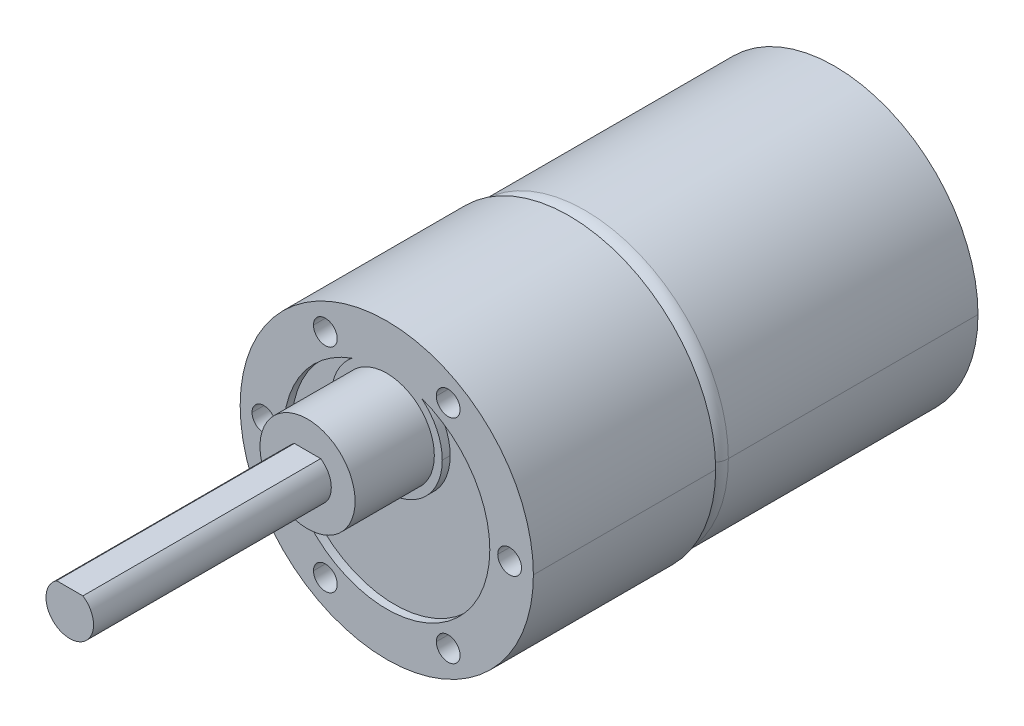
ISO-10303-21;
HEADER;
FILE_DESCRIPTION(('STEP AP214'),'2;1');
FILE_NAME('part.step','',(''),(''),'','','');
FILE_SCHEMA(('AUTOMOTIVE_DESIGN { 1 0 10303 214 1 1 1 1 }'));
ENDSEC;
DATA;
#1=APPLICATION_CONTEXT('core data for automotive mechanical design processes');
#2=APPLICATION_PROTOCOL_DEFINITION('international standard','automotive_design',2000,#1);
#3=PRODUCT_CONTEXT('',#1,'mechanical');
#4=PRODUCT('Part','Part','',(#3));
#5=PRODUCT_RELATED_PRODUCT_CATEGORY('part','',(#4));
#6=PRODUCT_DEFINITION_FORMATION('','',#4);
#7=PRODUCT_DEFINITION_CONTEXT('part definition',#1,'design');
#8=PRODUCT_DEFINITION('design','',#6,#7);
#9=PRODUCT_DEFINITION_SHAPE('','',#8);
#10=(LENGTH_UNIT() NAMED_UNIT(*) SI_UNIT(.MILLI.,.METRE.));
#11=(NAMED_UNIT(*) PLANE_ANGLE_UNIT() SI_UNIT($,.RADIAN.));
#12=(NAMED_UNIT(*) SI_UNIT($,.STERADIAN.) SOLID_ANGLE_UNIT());
#13=UNCERTAINTY_MEASURE_WITH_UNIT(LENGTH_MEASURE(1.E-05),#10,'distance_accuracy_value','');
#14=(GEOMETRIC_REPRESENTATION_CONTEXT(3) GLOBAL_UNCERTAINTY_ASSIGNED_CONTEXT((#13)) GLOBAL_UNIT_ASSIGNED_CONTEXT((#10,
#11,#12)) REPRESENTATION_CONTEXT('',''));
#15=CARTESIAN_POINT('',(0.,0.,0.));
#16=DIRECTION('',(0.,0.,1.));
#17=DIRECTION('',(1.,0.,0.));
#18=AXIS2_PLACEMENT_3D('',#15,#16,#17);
#19=CARTESIAN_POINT('',(0.,0.,-1.));
#20=DIRECTION('',(0.,0.,-1.));
#21=DIRECTION('',(-1.,0.,0.));
#22=AXIS2_PLACEMENT_3D('',#19,#20,#21);
#23=TOROIDAL_SURFACE('',#22,4.5,0.5);
#24=CARTESIAN_POINT('',(4.5,0.,-1.));
#25=DIRECTION('',(0.,1.,0.));
#26=DIRECTION('',(-1.,0.,0.));
#27=AXIS2_PLACEMENT_3D('',#24,#25,#26);
#28=CIRCLE('',#27,0.5);
#29=CARTESIAN_POINT('',(5.,0.,-1.));
#30=VERTEX_POINT('',#29);
#31=CARTESIAN_POINT('',(4.5,0.,-1.5));
#32=VERTEX_POINT('',#31);
#33=EDGE_CURVE('E555',#30,#32,#28,.T.);
#34=ORIENTED_EDGE('',*,*,#33,.F.);
#35=CARTESIAN_POINT('',(0.,0.,-1.));
#36=DIRECTION('',(0.,0.,1.));
#37=DIRECTION('',(-1.,0.,0.));
#38=AXIS2_PLACEMENT_3D('',#35,#36,#37);
#39=CIRCLE('',#38,5.);
#40=CARTESIAN_POINT('',(-5.,0.,-1.));
#41=VERTEX_POINT('',#40);
#42=EDGE_CURVE('E634',#41,#30,#39,.T.);
#43=ORIENTED_EDGE('',*,*,#42,.F.);
#44=CARTESIAN_POINT('',(-4.5,0.,-1.));
#45=DIRECTION('',(0.,-1.,0.));
#46=DIRECTION('',(0.,0.,-1.));
#47=AXIS2_PLACEMENT_3D('',#44,#45,#46);
#48=CIRCLE('',#47,0.5);
#49=CARTESIAN_POINT('',(-4.5,0.,-1.5));
#50=VERTEX_POINT('',#49);
#51=EDGE_CURVE('E625',#41,#50,#48,.T.);
#52=ORIENTED_EDGE('',*,*,#51,.T.);
#53=CARTESIAN_POINT('',(0.,0.,-1.5));
#54=DIRECTION('',(0.,0.,-1.));
#55=DIRECTION('',(-1.,0.,0.));
#56=AXIS2_PLACEMENT_3D('',#53,#54,#55);
#57=CIRCLE('',#56,4.5);
#58=EDGE_CURVE('E633',#32,#50,#57,.T.);
#59=ORIENTED_EDGE('',*,*,#58,.F.);
#60=EDGE_LOOP('',(#34,#43,#52,#59));
#61=FACE_BOUND('',#60,.T.);
#62=ADVANCED_FACE('F47',(#61),#23,.T.);
#63=CARTESIAN_POINT('',(0.,0.,-3.));
#64=DIRECTION('',(0.,0.,-1.));
#65=DIRECTION('',(-1.,0.,0.));
#66=AXIS2_PLACEMENT_3D('',#63,#64,#65);
#67=TOROIDAL_SURFACE('',#66,3.75,1.5);
#68=CARTESIAN_POINT('',(3.75,0.,-3.));
#69=DIRECTION('',(0.,1.,0.));
#70=DIRECTION('',(-1.,0.,0.));
#71=AXIS2_PLACEMENT_3D('',#68,#69,#70);
#72=CIRCLE('',#71,1.5);
#73=CARTESIAN_POINT('',(2.25,0.,-3.));
#74=VERTEX_POINT('',#73);
#75=CARTESIAN_POINT('',(3.75,0.,-1.5));
#76=VERTEX_POINT('',#75);
#77=EDGE_CURVE('E548',#74,#76,#72,.T.);
#78=ORIENTED_EDGE('',*,*,#77,.F.);
#79=CARTESIAN_POINT('',(0.,0.,-3.));
#80=DIRECTION('',(0.,0.,-1.));
#81=DIRECTION('',(-1.,0.,0.));
#82=AXIS2_PLACEMENT_3D('',#79,#80,#81);
#83=CIRCLE('',#82,2.25);
#84=CARTESIAN_POINT('',(-2.25,0.,-3.));
#85=VERTEX_POINT('',#84);
#86=EDGE_CURVE('E850',#85,#74,#83,.T.);
#87=ORIENTED_EDGE('',*,*,#86,.F.);
#88=CARTESIAN_POINT('',(-3.75,0.,-3.));
#89=DIRECTION('',(0.,-1.,0.));
#90=DIRECTION('',(0.,0.,-1.));
#91=AXIS2_PLACEMENT_3D('',#88,#89,#90);
#92=CIRCLE('',#91,1.5);
#93=CARTESIAN_POINT('',(-3.75,0.,-1.5));
#94=VERTEX_POINT('',#93);
#95=EDGE_CURVE('E612',#85,#94,#92,.T.);
#96=ORIENTED_EDGE('',*,*,#95,.T.);
#97=CARTESIAN_POINT('',(0.,0.,-1.5));
#98=DIRECTION('',(0.,0.,1.));
#99=DIRECTION('',(-1.,0.,0.));
#100=AXIS2_PLACEMENT_3D('',#97,#98,#99);
#101=CIRCLE('',#100,3.75);
#102=EDGE_CURVE('E853',#76,#94,#101,.T.);
#103=ORIENTED_EDGE('',*,*,#102,.F.);
#104=EDGE_LOOP('',(#78,#87,#96,#103));
#105=FACE_BOUND('',#104,.T.);
#106=ADVANCED_FACE('F1094',(#105),#67,.F.);
#107=CARTESIAN_POINT('',(-9.28492843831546,21.8553757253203,-4.5));
#108=DIRECTION('',(-0.93969262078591,-0.342020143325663,0.));
#109=DIRECTION('',(-0.342020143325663,0.93969262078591,0.));
#110=AXIS2_PLACEMENT_3D('',#107,#108,#109);
#111=PLANE('',#110);
#112=DIRECTION('',(0.,0.,1.));
#113=VECTOR('',#112,1.);
#114=CARTESIAN_POINT('',(2.84412090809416,-11.4689134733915,-4.5));
#115=LINE('',#114,#113);
#116=CARTESIAN_POINT('',(2.84412090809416,-11.4689134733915,-4.5));
#117=VERTEX_POINT('',#116);
#118=CARTESIAN_POINT('',(2.84412090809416,-11.4689134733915,0.5));
#119=VERTEX_POINT('',#118);
#120=EDGE_CURVE('E849',#117,#119,#115,.T.);
#121=ORIENTED_EDGE('',*,*,#120,.T.);
#122=DIRECTION('',(0.342020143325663,-0.93969262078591,0.));
#123=VECTOR('',#122,1.);
#124=CARTESIAN_POINT('',(-9.28492843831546,21.8553757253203,0.5));
#125=LINE('',#124,#123);
#126=CARTESIAN_POINT('',(3.01513097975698,-11.9387597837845,0.5));
#127=VERTEX_POINT('',#126);
#128=EDGE_CURVE('E688',#119,#127,#125,.T.);
#129=ORIENTED_EDGE('',*,*,#128,.T.);
#130=DIRECTION('',(0.,0.,-1.));
#131=VECTOR('',#130,1.);
#132=CARTESIAN_POINT('',(3.01513097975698,-11.9387597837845,-4.5));
#133=LINE('',#132,#131);
#134=CARTESIAN_POINT('',(3.01513097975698,-11.9387597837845,-4.5));
#135=VERTEX_POINT('',#134);
#136=EDGE_CURVE('E789',#127,#135,#133,.T.);
#137=ORIENTED_EDGE('',*,*,#136,.T.);
#138=DIRECTION('',(0.342020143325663,-0.93969262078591,0.));
#139=VECTOR('',#138,1.);
#140=CARTESIAN_POINT('',(-9.28492843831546,21.8553757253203,-4.5));
#141=LINE('',#140,#139);
#142=EDGE_CURVE('E686',#117,#135,#141,.T.);
#143=ORIENTED_EDGE('',*,*,#142,.F.);
#144=EDGE_LOOP('',(#121,#129,#137,#143));
#145=FACE_BOUND('',#144,.T.);
#146=ADVANCED_FACE('F1100',(#145),#111,.F.);
#147=CARTESIAN_POINT('',(-6.93569688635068,22.7104260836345,0.5));
#148=DIRECTION('',(0.,0.,1.));
#149=DIRECTION('',(1.,0.,0.));
#150=AXIS2_PLACEMENT_3D('',#147,#148,#149);
#151=PLANE('',#150);
#152=DIRECTION('',(0.939692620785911,0.342020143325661,0.));
#153=VECTOR('',#152,1.);
#154=CARTESIAN_POINT('',(5.19335246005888,-10.6138631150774,0.5));
#155=LINE('',#154,#153);
#156=CARTESIAN_POINT('',(5.19335246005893,-10.6138631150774,0.5));
#157=VERTEX_POINT('',#156);
#158=EDGE_CURVE('E790',#119,#157,#155,.T.);
#159=ORIENTED_EDGE('',*,*,#158,.T.);
#160=DIRECTION('',(0.342020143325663,-0.93969262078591,0.));
#161=VECTOR('',#160,1.);
#162=CARTESIAN_POINT('',(-6.93569688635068,22.7104260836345,0.5));
#163=LINE('',#162,#161);
#164=CARTESIAN_POINT('',(5.36436253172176,-11.0837094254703,0.5));
#165=VERTEX_POINT('',#164);
#166=EDGE_CURVE('E692',#157,#165,#163,.T.);
#167=ORIENTED_EDGE('',*,*,#166,.T.);
#168=DIRECTION('',(-0.93969262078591,-0.342020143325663,0.));
#169=VECTOR('',#168,1.);
#170=CARTESIAN_POINT('',(5.36436253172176,-11.0837094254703,0.5));
#171=LINE('',#170,#169);
#172=EDGE_CURVE('E784',#165,#127,#171,.T.);
#173=ORIENTED_EDGE('',*,*,#172,.T.);
#174=ORIENTED_EDGE('',*,*,#128,.F.);
#175=EDGE_LOOP('',(#159,#167,#173,#174));
#176=FACE_BOUND('',#175,.T.);
#177=ADVANCED_FACE('F1150',(#176),#151,.F.);
#178=CARTESIAN_POINT('',(-6.93569688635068,22.7104260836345,-4.5));
#179=DIRECTION('',(0.93969262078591,0.342020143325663,0.));
#180=DIRECTION('',(0.,0.,-1.));
#181=AXIS2_PLACEMENT_3D('',#178,#179,#180);
#182=PLANE('',#181);
#183=DIRECTION('',(0.,0.,-1.));
#184=VECTOR('',#183,1.);
#185=CARTESIAN_POINT('',(5.19335246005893,-10.6138631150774,-4.5));
#186=LINE('',#185,#184);
#187=CARTESIAN_POINT('',(5.19335246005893,-10.6138631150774,-4.5));
#188=VERTEX_POINT('',#187);
#189=EDGE_CURVE('E794',#157,#188,#186,.T.);
#190=ORIENTED_EDGE('',*,*,#189,.T.);
#191=DIRECTION('',(0.342020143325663,-0.93969262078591,0.));
#192=VECTOR('',#191,1.);
#193=CARTESIAN_POINT('',(-6.93569688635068,22.7104260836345,-4.5));
#194=LINE('',#193,#192);
#195=CARTESIAN_POINT('',(5.36436253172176,-11.0837094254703,-4.5));
#196=VERTEX_POINT('',#195);
#197=EDGE_CURVE('E881',#188,#196,#194,.T.);
#198=ORIENTED_EDGE('',*,*,#197,.T.);
#199=DIRECTION('',(0.,0.,1.));
#200=VECTOR('',#199,1.);
#201=CARTESIAN_POINT('',(5.36436253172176,-11.0837094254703,-4.5));
#202=LINE('',#201,#200);
#203=EDGE_CURVE('E873',#196,#165,#202,.T.);
#204=ORIENTED_EDGE('',*,*,#203,.T.);
#205=ORIENTED_EDGE('',*,*,#166,.F.);
#206=EDGE_LOOP('',(#190,#198,#204,#205));
#207=FACE_BOUND('',#206,.T.);
#208=ADVANCED_FACE('F1382',(#207),#182,.F.);
#209=CARTESIAN_POINT('',(-6.93569688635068,22.7104260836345,-4.5));
#210=DIRECTION('',(0.,0.,-1.));
#211=DIRECTION('',(0.,-1.,0.));
#212=AXIS2_PLACEMENT_3D('',#209,#210,#211);
#213=PLANE('',#212);
#214=DIRECTION('',(-0.939692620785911,-0.342020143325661,0.));
#215=VECTOR('',#214,1.);
#216=CARTESIAN_POINT('',(5.19335246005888,-10.6138631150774,-4.5));
#217=LINE('',#216,#215);
#218=EDGE_CURVE('E915',#188,#117,#217,.T.);
#219=ORIENTED_EDGE('',*,*,#218,.T.);
#220=ORIENTED_EDGE('',*,*,#142,.T.);
#221=DIRECTION('',(0.93969262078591,0.342020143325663,0.));
#222=VECTOR('',#221,1.);
#223=CARTESIAN_POINT('',(5.36436253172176,-11.0837094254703,-4.5));
#224=LINE('',#223,#222);
#225=EDGE_CURVE('E869',#135,#196,#224,.T.);
#226=ORIENTED_EDGE('',*,*,#225,.T.);
#227=ORIENTED_EDGE('',*,*,#197,.F.);
#228=EDGE_LOOP('',(#219,#220,#226,#227));
#229=FACE_BOUND('',#228,.T.);
#230=ADVANCED_FACE('F1308',(#229),#213,.F.);
#231=CARTESIAN_POINT('',(-0.469846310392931,-0.171010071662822,-3.5));
#232=DIRECTION('',(0.342020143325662,-0.939692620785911,0.));
#233=DIRECTION('',(0.939692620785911,0.342020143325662,0.));
#234=AXIS2_PLACEMENT_3D('',#231,#232,#233);
#235=CYLINDRICAL_SURFACE('',#234,2.);
#236=CARTESIAN_POINT('',(3.71990044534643,-11.6822446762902,-3.5));
#237=DIRECTION('',(0.342020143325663,-0.93969262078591,0.));
#238=DIRECTION('',(-0.93969262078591,-0.342020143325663,0.));
#239=AXIS2_PLACEMENT_3D('',#236,#237,#238);
#240=CIRCLE('',#239,2.);
#241=CARTESIAN_POINT('',(1.84051520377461,-12.3662849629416,-3.5));
#242=VERTEX_POINT('',#241);
#243=CARTESIAN_POINT('',(3.71990044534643,-11.6822446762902,-5.5));
#244=VERTEX_POINT('',#243);
#245=EDGE_CURVE('E930',#242,#244,#240,.T.);
#246=ORIENTED_EDGE('',*,*,#245,.F.);
#247=DIRECTION('',(0.342020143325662,-0.939692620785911,0.));
#248=VECTOR('',#247,1.);
#249=CARTESIAN_POINT('',(1.84051520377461,-12.3662849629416,-3.5));
#250=LINE('',#249,#248);
#251=CARTESIAN_POINT('',(1.66950513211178,-11.8964386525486,-3.5));
#252=VERTEX_POINT('',#251);
#253=EDGE_CURVE('E845',#252,#242,#250,.T.);
#254=ORIENTED_EDGE('',*,*,#253,.F.);
#255=CARTESIAN_POINT('',(3.5488903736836,-11.2123983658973,-3.5));
#256=DIRECTION('',(-0.342020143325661,0.939692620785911,0.));
#257=DIRECTION('',(0.939692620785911,0.342020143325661,0.));
#258=AXIS2_PLACEMENT_3D('',#255,#256,#257);
#259=CIRCLE('',#258,2.);
#260=CARTESIAN_POINT('',(3.5488903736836,-11.2123983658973,-5.5));
#261=VERTEX_POINT('',#260);
#262=EDGE_CURVE('E846',#261,#252,#259,.T.);
#263=ORIENTED_EDGE('',*,*,#262,.F.);
#264=DIRECTION('',(-0.342020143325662,0.939692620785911,0.));
#265=VECTOR('',#264,1.);
#266=CARTESIAN_POINT('',(3.5488903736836,-11.2123983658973,-5.5));
#267=LINE('',#266,#265);
#268=EDGE_CURVE('E683',#244,#261,#267,.T.);
#269=ORIENTED_EDGE('',*,*,#268,.F.);
#270=EDGE_LOOP('',(#246,#254,#263,#269));
#271=FACE_BOUND('',#270,.T.);
#272=ADVANCED_FACE('F1304',(#271),#235,.T.);
#273=CARTESIAN_POINT('',(0.469846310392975,0.171010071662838,-3.5));
#274=DIRECTION('',(-0.342020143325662,0.939692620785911,0.));
#275=DIRECTION('',(-0.939692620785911,-0.342020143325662,0.));
#276=AXIS2_PLACEMENT_3D('',#273,#274,#275);
#277=CYLINDRICAL_SURFACE('',#276,2.);
#278=CARTESIAN_POINT('',(4.48858299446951,-10.8703782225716,-3.5));
#279=DIRECTION('',(-0.342020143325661,0.939692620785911,0.));
#280=DIRECTION('',(0.939692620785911,0.342020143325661,0.));
#281=AXIS2_PLACEMENT_3D('',#278,#279,#280);
#282=CIRCLE('',#281,2.);
#283=CARTESIAN_POINT('',(6.36796823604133,-10.1863379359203,-3.5));
#284=VERTEX_POINT('',#283);
#285=CARTESIAN_POINT('',(4.48858299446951,-10.8703782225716,-5.5));
#286=VERTEX_POINT('',#285);
#287=EDGE_CURVE('E840',#284,#286,#282,.T.);
#288=ORIENTED_EDGE('',*,*,#287,.F.);
#289=DIRECTION('',(-0.342020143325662,0.939692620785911,0.));
#290=VECTOR('',#289,1.);
#291=CARTESIAN_POINT('',(6.36796823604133,-10.1863379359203,-3.5));
#292=LINE('',#291,#290);
#293=CARTESIAN_POINT('',(6.53897830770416,-10.6561842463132,-3.5));
#294=VERTEX_POINT('',#293);
#295=EDGE_CURVE('E621',#294,#284,#292,.T.);
#296=ORIENTED_EDGE('',*,*,#295,.F.);
#297=CARTESIAN_POINT('',(4.65959306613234,-11.3402245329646,-3.5));
#298=DIRECTION('',(0.342020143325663,-0.93969262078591,0.));
#299=DIRECTION('',(-0.93969262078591,-0.342020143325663,0.));
#300=AXIS2_PLACEMENT_3D('',#297,#298,#299);
#301=CIRCLE('',#300,2.);
#302=CARTESIAN_POINT('',(4.65959306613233,-11.3402245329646,-5.5));
#303=VERTEX_POINT('',#302);
#304=EDGE_CURVE('E783',#303,#294,#301,.T.);
#305=ORIENTED_EDGE('',*,*,#304,.F.);
#306=DIRECTION('',(0.342020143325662,-0.939692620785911,0.));
#307=VECTOR('',#306,1.);
#308=CARTESIAN_POINT('',(4.65959306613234,-11.3402245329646,-5.5));
#309=LINE('',#308,#307);
#310=EDGE_CURVE('E687',#286,#303,#309,.T.);
#311=ORIENTED_EDGE('',*,*,#310,.F.);
#312=EDGE_LOOP('',(#288,#296,#305,#311));
#313=FACE_BOUND('',#312,.T.);
#314=ADVANCED_FACE('F1307',(#313),#277,.T.);
#315=CARTESIAN_POINT('',(0.,0.,-5.5));
#316=DIRECTION('',(0.,0.,-1.));
#317=DIRECTION('',(0.,-1.,0.));
#318=AXIS2_PLACEMENT_3D('',#315,#316,#317);
#319=PLANE('',#318);
#320=DIRECTION('',(0.939692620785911,0.342020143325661,0.));
#321=VECTOR('',#320,1.);
#322=CARTESIAN_POINT('',(1.66950513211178,-11.8964386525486,-5.5));
#323=LINE('',#322,#321);
#324=EDGE_CURVE('E844',#261,#286,#323,.T.);
#325=ORIENTED_EDGE('',*,*,#324,.T.);
#326=ORIENTED_EDGE('',*,*,#310,.T.);
#327=DIRECTION('',(-0.939692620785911,-0.342020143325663,0.));
#328=VECTOR('',#327,1.);
#329=CARTESIAN_POINT('',(1.84051520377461,-12.3662849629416,-5.5));
#330=LINE('',#329,#328);
#331=EDGE_CURVE('E620',#303,#244,#330,.T.);
#332=ORIENTED_EDGE('',*,*,#331,.T.);
#333=ORIENTED_EDGE('',*,*,#268,.T.);
#334=EDGE_LOOP('',(#325,#326,#332,#333));
#335=FACE_BOUND('',#334,.T.);
#336=ADVANCED_FACE('F1340',(#335),#319,.T.);
#337=CARTESIAN_POINT('',(1.66950513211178,-11.8964386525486,-5.5));
#338=DIRECTION('',(0.342020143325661,-0.939692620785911,0.));
#339=DIRECTION('',(0.,0.,-1.));
#340=AXIS2_PLACEMENT_3D('',#337,#338,#339);
#341=PLANE('',#340);
#342=ORIENTED_EDGE('',*,*,#120,.F.);
#343=ORIENTED_EDGE('',*,*,#218,.F.);
#344=ORIENTED_EDGE('',*,*,#189,.F.);
#345=ORIENTED_EDGE('',*,*,#158,.F.);
#346=EDGE_LOOP('',(#342,#343,#344,#345));
#347=FACE_BOUND('',#346,.T.);
#348=DIRECTION('',(0.,0.,1.));
#349=VECTOR('',#348,1.);
#350=CARTESIAN_POINT('',(6.36796823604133,-10.1863379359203,-5.5));
#351=LINE('',#350,#349);
#352=CARTESIAN_POINT('',(6.36796823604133,-10.1863379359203,1.5));
#353=VERTEX_POINT('',#352);
#354=EDGE_CURVE('E617',#284,#353,#351,.T.);
#355=ORIENTED_EDGE('',*,*,#354,.F.);
#356=ORIENTED_EDGE('',*,*,#287,.T.);
#357=ORIENTED_EDGE('',*,*,#324,.F.);
#358=ORIENTED_EDGE('',*,*,#262,.T.);
#359=DIRECTION('',(0.,0.,1.));
#360=VECTOR('',#359,1.);
#361=CARTESIAN_POINT('',(1.66950513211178,-11.8964386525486,-5.5));
#362=LINE('',#361,#360);
#363=CARTESIAN_POINT('',(1.66950513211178,-11.8964386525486,1.5));
#364=VERTEX_POINT('',#363);
#365=EDGE_CURVE('E788',#252,#364,#362,.T.);
#366=ORIENTED_EDGE('',*,*,#365,.T.);
#367=DIRECTION('',(0.939692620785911,0.342020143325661,0.));
#368=VECTOR('',#367,1.);
#369=CARTESIAN_POINT('',(1.66950513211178,-11.8964386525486,1.5));
#370=LINE('',#369,#368);
#371=EDGE_CURVE('E727',#364,#353,#370,.T.);
#372=ORIENTED_EDGE('',*,*,#371,.T.);
#373=EDGE_LOOP('',(#355,#356,#357,#358,#366,#372));
#374=FACE_BOUND('',#373,.T.);
#375=ADVANCED_FACE('F1337',(#347,#374),#341,.F.);
#376=CARTESIAN_POINT('',(1.84051520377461,-12.3662849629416,-5.5));
#377=DIRECTION('',(0.939692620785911,0.342020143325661,0.));
#378=DIRECTION('',(0.,0.,-1.));
#379=AXIS2_PLACEMENT_3D('',#376,#377,#378);
#380=PLANE('',#379);
#381=ORIENTED_EDGE('',*,*,#365,.F.);
#382=ORIENTED_EDGE('',*,*,#253,.T.);
#383=DIRECTION('',(0.,0.,1.));
#384=VECTOR('',#383,1.);
#385=CARTESIAN_POINT('',(1.84051520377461,-12.3662849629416,-5.5));
#386=LINE('',#385,#384);
#387=CARTESIAN_POINT('',(1.84051520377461,-12.3662849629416,1.5));
#388=VERTEX_POINT('',#387);
#389=EDGE_CURVE('E927',#242,#388,#386,.T.);
#390=ORIENTED_EDGE('',*,*,#389,.T.);
#391=DIRECTION('',(-0.342020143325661,0.939692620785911,0.));
#392=VECTOR('',#391,1.);
#393=CARTESIAN_POINT('',(1.84051520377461,-12.3662849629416,1.5));
#394=LINE('',#393,#392);
#395=EDGE_CURVE('E731',#388,#364,#394,.T.);
#396=ORIENTED_EDGE('',*,*,#395,.T.);
#397=EDGE_LOOP('',(#381,#382,#390,#396));
#398=FACE_BOUND('',#397,.T.);
#399=ADVANCED_FACE('F1339',(#398),#380,.F.);
#400=CARTESIAN_POINT('',(1.84051520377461,-12.3662849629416,-5.5));
#401=DIRECTION('',(-0.342020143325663,0.93969262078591,0.));
#402=DIRECTION('',(0.,0.,1.));
#403=AXIS2_PLACEMENT_3D('',#400,#401,#402);
#404=PLANE('',#403);
#405=ORIENTED_EDGE('',*,*,#203,.F.);
#406=ORIENTED_EDGE('',*,*,#225,.F.);
#407=ORIENTED_EDGE('',*,*,#136,.F.);
#408=ORIENTED_EDGE('',*,*,#172,.F.);
#409=EDGE_LOOP('',(#405,#406,#407,#408));
#410=FACE_BOUND('',#409,.T.);
#411=ORIENTED_EDGE('',*,*,#331,.F.);
#412=ORIENTED_EDGE('',*,*,#304,.T.);
#413=DIRECTION('',(0.,0.,1.));
#414=VECTOR('',#413,1.);
#415=CARTESIAN_POINT('',(6.53897830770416,-10.6561842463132,-5.5));
#416=LINE('',#415,#414);
#417=CARTESIAN_POINT('',(6.53897830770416,-10.6561842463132,1.5));
#418=VERTEX_POINT('',#417);
#419=EDGE_CURVE('E968',#294,#418,#416,.T.);
#420=ORIENTED_EDGE('',*,*,#419,.T.);
#421=DIRECTION('',(-0.939692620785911,-0.342020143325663,0.));
#422=VECTOR('',#421,1.);
#423=CARTESIAN_POINT('',(1.84051520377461,-12.3662849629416,1.5));
#424=LINE('',#423,#422);
#425=EDGE_CURVE('E635',#418,#388,#424,.T.);
#426=ORIENTED_EDGE('',*,*,#425,.T.);
#427=ORIENTED_EDGE('',*,*,#389,.F.);
#428=ORIENTED_EDGE('',*,*,#245,.T.);
#429=EDGE_LOOP('',(#411,#412,#420,#426,#427,#428));
#430=FACE_BOUND('',#429,.T.);
#431=ADVANCED_FACE('F1156',(#410,#430),#404,.F.);
#432=CARTESIAN_POINT('',(6.53897830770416,-10.6561842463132,-5.5));
#433=DIRECTION('',(-0.939692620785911,-0.342020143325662,0.));
#434=DIRECTION('',(-0.342020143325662,0.939692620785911,0.));
#435=AXIS2_PLACEMENT_3D('',#432,#433,#434);
#436=PLANE('',#435);
#437=ORIENTED_EDGE('',*,*,#419,.F.);
#438=ORIENTED_EDGE('',*,*,#295,.T.);
#439=ORIENTED_EDGE('',*,*,#354,.T.);
#440=DIRECTION('',(0.342020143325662,-0.939692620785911,0.));
#441=VECTOR('',#440,1.);
#442=CARTESIAN_POINT('',(6.53897830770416,-10.6561842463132,1.5));
#443=LINE('',#442,#441);
#444=EDGE_CURVE('E639',#353,#418,#443,.T.);
#445=ORIENTED_EDGE('',*,*,#444,.T.);
#446=EDGE_LOOP('',(#437,#438,#439,#445));
#447=FACE_BOUND('',#446,.T.);
#448=ADVANCED_FACE('F1152',(#447),#436,.F.);
#449=CARTESIAN_POINT('',(6.93569688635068,-22.7104260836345,-4.5));
#450=DIRECTION('',(0.,0.,-1.));
#451=DIRECTION('',(0.,-1.,0.));
#452=AXIS2_PLACEMENT_3D('',#449,#450,#451);
#453=PLANE('',#452);
#454=DIRECTION('',(0.939692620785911,0.342020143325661,0.));
#455=VECTOR('',#454,1.);
#456=CARTESIAN_POINT('',(-5.19335246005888,10.6138631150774,-4.5));
#457=LINE('',#456,#455);
#458=CARTESIAN_POINT('',(-5.19335246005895,10.6138631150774,-4.5));
#459=VERTEX_POINT('',#458);
#460=CARTESIAN_POINT('',(-2.84412090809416,11.4689134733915,-4.5));
#461=VERTEX_POINT('',#460);
#462=EDGE_CURVE('E668',#459,#461,#457,.T.);
#463=ORIENTED_EDGE('',*,*,#462,.T.);
#464=DIRECTION('',(-0.342020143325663,0.93969262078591,0.));
#465=VECTOR('',#464,1.);
#466=CARTESIAN_POINT('',(9.28492843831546,-21.8553757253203,-4.5));
#467=LINE('',#466,#465);
#468=CARTESIAN_POINT('',(-3.01513097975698,11.9387597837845,-4.5));
#469=VERTEX_POINT('',#468);
#470=EDGE_CURVE('E726',#461,#469,#467,.T.);
#471=ORIENTED_EDGE('',*,*,#470,.T.);
#472=DIRECTION('',(-0.93969262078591,-0.342020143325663,0.));
#473=VECTOR('',#472,1.);
#474=CARTESIAN_POINT('',(-5.36436253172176,11.0837094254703,-4.5));
#475=LINE('',#474,#473);
#476=CARTESIAN_POINT('',(-5.36436253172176,11.0837094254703,-4.5));
#477=VERTEX_POINT('',#476);
#478=EDGE_CURVE('E667',#469,#477,#475,.T.);
#479=ORIENTED_EDGE('',*,*,#478,.T.);
#480=DIRECTION('',(-0.342020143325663,0.93969262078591,0.));
#481=VECTOR('',#480,1.);
#482=CARTESIAN_POINT('',(6.93569688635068,-22.7104260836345,-4.5));
#483=LINE('',#482,#481);
#484=EDGE_CURVE('E902',#459,#477,#483,.T.);
#485=ORIENTED_EDGE('',*,*,#484,.F.);
#486=EDGE_LOOP('',(#463,#471,#479,#485));
#487=FACE_BOUND('',#486,.T.);
#488=ADVANCED_FACE('F1155',(#487),#453,.F.);
#489=CARTESIAN_POINT('',(6.93569688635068,-22.7104260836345,-4.5));
#490=DIRECTION('',(-0.93969262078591,-0.342020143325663,0.));
#491=DIRECTION('',(-0.342020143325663,0.93969262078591,0.));
#492=AXIS2_PLACEMENT_3D('',#489,#490,#491);
#493=PLANE('',#492);
#494=DIRECTION('',(0.,0.,-1.));
#495=VECTOR('',#494,1.);
#496=CARTESIAN_POINT('',(-5.19335246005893,10.6138631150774,-4.5));
#497=LINE('',#496,#495);
#498=CARTESIAN_POINT('',(-5.19335246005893,10.6138631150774,0.5));
#499=VERTEX_POINT('',#498);
#500=EDGE_CURVE('E672',#499,#459,#497,.T.);
#501=ORIENTED_EDGE('',*,*,#500,.T.);
#502=ORIENTED_EDGE('',*,*,#484,.T.);
#503=DIRECTION('',(0.,0.,1.));
#504=VECTOR('',#503,1.);
#505=CARTESIAN_POINT('',(-5.36436253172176,11.0837094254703,-4.5));
#506=LINE('',#505,#504);
#507=CARTESIAN_POINT('',(-5.36436253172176,11.0837094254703,0.5));
#508=VERTEX_POINT('',#507);
#509=EDGE_CURVE('E887',#477,#508,#506,.T.);
#510=ORIENTED_EDGE('',*,*,#509,.T.);
#511=DIRECTION('',(-0.342020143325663,0.93969262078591,0.));
#512=VECTOR('',#511,1.);
#513=CARTESIAN_POINT('',(6.93569688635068,-22.7104260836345,0.5));
#514=LINE('',#513,#512);
#515=EDGE_CURVE('E734',#499,#508,#514,.T.);
#516=ORIENTED_EDGE('',*,*,#515,.F.);
#517=EDGE_LOOP('',(#501,#502,#510,#516));
#518=FACE_BOUND('',#517,.T.);
#519=ADVANCED_FACE('F1162',(#518),#493,.F.);
#520=CARTESIAN_POINT('',(6.93569688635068,-22.7104260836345,0.5));
#521=DIRECTION('',(0.,0.,1.));
#522=DIRECTION('',(1.,0.,0.));
#523=AXIS2_PLACEMENT_3D('',#520,#521,#522);
#524=PLANE('',#523);
#525=DIRECTION('',(-0.939692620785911,-0.342020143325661,0.));
#526=VECTOR('',#525,1.);
#527=CARTESIAN_POINT('',(-5.19335246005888,10.6138631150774,0.5));
#528=LINE('',#527,#526);
#529=CARTESIAN_POINT('',(-2.84412090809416,11.4689134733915,0.5));
#530=VERTEX_POINT('',#529);
#531=EDGE_CURVE('E776',#530,#499,#528,.T.);
#532=ORIENTED_EDGE('',*,*,#531,.T.);
#533=ORIENTED_EDGE('',*,*,#515,.T.);
#534=DIRECTION('',(0.93969262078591,0.342020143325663,0.));
#535=VECTOR('',#534,1.);
#536=CARTESIAN_POINT('',(-5.36436253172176,11.0837094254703,0.5));
#537=LINE('',#536,#535);
#538=CARTESIAN_POINT('',(-3.01513097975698,11.9387597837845,0.5));
#539=VERTEX_POINT('',#538);
#540=EDGE_CURVE('E953',#508,#539,#537,.T.);
#541=ORIENTED_EDGE('',*,*,#540,.T.);
#542=DIRECTION('',(-0.342020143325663,0.93969262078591,0.));
#543=VECTOR('',#542,1.);
#544=CARTESIAN_POINT('',(9.28492843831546,-21.8553757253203,0.5));
#545=LINE('',#544,#543);
#546=EDGE_CURVE('E586',#530,#539,#545,.T.);
#547=ORIENTED_EDGE('',*,*,#546,.F.);
#548=EDGE_LOOP('',(#532,#533,#541,#547));
#549=FACE_BOUND('',#548,.T.);
#550=ADVANCED_FACE('F1158',(#549),#524,.F.);
#551=CARTESIAN_POINT('',(9.28492843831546,-21.8553757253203,-4.5));
#552=DIRECTION('',(0.93969262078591,0.342020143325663,0.));
#553=DIRECTION('',(0.,0.,-1.));
#554=AXIS2_PLACEMENT_3D('',#551,#552,#553);
#555=PLANE('',#554);
#556=DIRECTION('',(0.,0.,1.));
#557=VECTOR('',#556,1.);
#558=CARTESIAN_POINT('',(-2.84412090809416,11.4689134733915,-4.5));
#559=LINE('',#558,#557);
#560=EDGE_CURVE('E673',#461,#530,#559,.T.);
#561=ORIENTED_EDGE('',*,*,#560,.T.);
#562=ORIENTED_EDGE('',*,*,#546,.T.);
#563=DIRECTION('',(0.,0.,-1.));
#564=VECTOR('',#563,1.);
#565=CARTESIAN_POINT('',(-3.01513097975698,11.9387597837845,-4.5));
#566=LINE('',#565,#564);
#567=EDGE_CURVE('E949',#539,#469,#566,.T.);
#568=ORIENTED_EDGE('',*,*,#567,.T.);
#569=ORIENTED_EDGE('',*,*,#470,.F.);
#570=EDGE_LOOP('',(#561,#562,#568,#569));
#571=FACE_BOUND('',#570,.T.);
#572=ADVANCED_FACE('F1161',(#571),#555,.F.);
#573=CARTESIAN_POINT('',(0.469846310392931,0.171010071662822,-3.5));
#574=DIRECTION('',(-0.342020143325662,0.939692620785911,0.));
#575=DIRECTION('',(-0.939692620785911,-0.342020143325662,0.));
#576=AXIS2_PLACEMENT_3D('',#573,#574,#575);
#577=CYLINDRICAL_SURFACE('',#576,2.);
#578=CARTESIAN_POINT('',(-3.71990044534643,11.6822446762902,-3.5));
#579=DIRECTION('',(-0.342020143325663,0.93969262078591,0.));
#580=DIRECTION('',(0.93969262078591,0.342020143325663,0.));
#581=AXIS2_PLACEMENT_3D('',#578,#579,#580);
#582=CIRCLE('',#581,2.);
#583=CARTESIAN_POINT('',(-1.84051520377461,12.3662849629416,-3.5));
#584=VERTEX_POINT('',#583);
#585=CARTESIAN_POINT('',(-3.71990044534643,11.6822446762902,-5.5));
#586=VERTEX_POINT('',#585);
#587=EDGE_CURVE('E663',#584,#586,#582,.T.);
#588=ORIENTED_EDGE('',*,*,#587,.F.);
#589=DIRECTION('',(-0.342020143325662,0.939692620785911,0.));
#590=VECTOR('',#589,1.);
#591=CARTESIAN_POINT('',(-1.84051520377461,12.3662849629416,-3.5));
#592=LINE('',#591,#590);
#593=CARTESIAN_POINT('',(-1.66950513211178,11.8964386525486,-3.5));
#594=VERTEX_POINT('',#593);
#595=EDGE_CURVE('E767',#594,#584,#592,.T.);
#596=ORIENTED_EDGE('',*,*,#595,.F.);
#597=CARTESIAN_POINT('',(-3.5488903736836,11.2123983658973,-3.5));
#598=DIRECTION('',(0.342020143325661,-0.939692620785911,0.));
#599=DIRECTION('',(-0.939692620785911,-0.342020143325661,0.));
#600=AXIS2_PLACEMENT_3D('',#597,#598,#599);
#601=CIRCLE('',#600,2.);
#602=CARTESIAN_POINT('',(-3.5488903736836,11.2123983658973,-5.5));
#603=VERTEX_POINT('',#602);
#604=EDGE_CURVE('E988',#603,#594,#601,.T.);
#605=ORIENTED_EDGE('',*,*,#604,.F.);
#606=DIRECTION('',(0.342020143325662,-0.939692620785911,0.));
#607=VECTOR('',#606,1.);
#608=CARTESIAN_POINT('',(-3.5488903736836,11.2123983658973,-5.5));
#609=LINE('',#608,#607);
#610=EDGE_CURVE('E583',#586,#603,#609,.T.);
#611=ORIENTED_EDGE('',*,*,#610,.F.);
#612=EDGE_LOOP('',(#588,#596,#605,#611));
#613=FACE_BOUND('',#612,.T.);
#614=ADVANCED_FACE('F1105',(#613),#577,.T.);
#615=CARTESIAN_POINT('',(-0.469846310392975,-0.171010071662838,-3.5));
#616=DIRECTION('',(0.342020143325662,-0.939692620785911,0.));
#617=DIRECTION('',(0.939692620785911,0.342020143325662,0.));
#618=AXIS2_PLACEMENT_3D('',#615,#616,#617);
#619=CYLINDRICAL_SURFACE('',#618,2.);
#620=CARTESIAN_POINT('',(-4.48858299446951,10.8703782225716,-3.5));
#621=DIRECTION('',(0.342020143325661,-0.939692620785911,0.));
#622=DIRECTION('',(-0.939692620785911,-0.342020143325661,0.));
#623=AXIS2_PLACEMENT_3D('',#620,#621,#622);
#624=CIRCLE('',#623,2.);
#625=CARTESIAN_POINT('',(-6.36796823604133,10.1863379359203,-3.5));
#626=VERTEX_POINT('',#625);
#627=CARTESIAN_POINT('',(-4.48858299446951,10.8703782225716,-5.5));
#628=VERTEX_POINT('',#627);
#629=EDGE_CURVE('E762',#626,#628,#624,.T.);
#630=ORIENTED_EDGE('',*,*,#629,.F.);
#631=DIRECTION('',(0.342020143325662,-0.939692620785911,0.));
#632=VECTOR('',#631,1.);
#633=CARTESIAN_POINT('',(-6.36796823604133,10.1863379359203,-3.5));
#634=LINE('',#633,#632);
#635=CARTESIAN_POINT('',(-6.53897830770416,10.6561842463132,-3.5));
#636=VERTEX_POINT('',#635);
#637=EDGE_CURVE('E715',#636,#626,#634,.T.);
#638=ORIENTED_EDGE('',*,*,#637,.F.);
#639=CARTESIAN_POINT('',(-4.65959306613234,11.3402245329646,-3.5));
#640=DIRECTION('',(-0.342020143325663,0.93969262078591,0.));
#641=DIRECTION('',(0.93969262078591,0.342020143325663,0.));
#642=AXIS2_PLACEMENT_3D('',#639,#640,#641);
#643=CIRCLE('',#642,2.);
#644=CARTESIAN_POINT('',(-4.65959306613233,11.3402245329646,-5.5));
#645=VERTEX_POINT('',#644);
#646=EDGE_CURVE('E654',#645,#636,#643,.T.);
#647=ORIENTED_EDGE('',*,*,#646,.F.);
#648=DIRECTION('',(-0.342020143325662,0.939692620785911,0.));
#649=VECTOR('',#648,1.);
#650=CARTESIAN_POINT('',(-4.65959306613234,11.3402245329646,-5.5));
#651=LINE('',#650,#649);
#652=EDGE_CURVE('E587',#628,#645,#651,.T.);
#653=ORIENTED_EDGE('',*,*,#652,.F.);
#654=EDGE_LOOP('',(#630,#638,#647,#653));
#655=FACE_BOUND('',#654,.T.);
#656=ADVANCED_FACE('F1197',(#655),#619,.T.);
#657=CARTESIAN_POINT('',(0.,0.,-5.5));
#658=DIRECTION('',(0.,0.,-1.));
#659=DIRECTION('',(0.,-1.,0.));
#660=AXIS2_PLACEMENT_3D('',#657,#658,#659);
#661=PLANE('',#660);
#662=DIRECTION('',(-0.939692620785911,-0.342020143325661,0.));
#663=VECTOR('',#662,1.);
#664=CARTESIAN_POINT('',(-1.66950513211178,11.8964386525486,-5.5));
#665=LINE('',#664,#663);
#666=EDGE_CURVE('E766',#603,#628,#665,.T.);
#667=ORIENTED_EDGE('',*,*,#666,.T.);
#668=ORIENTED_EDGE('',*,*,#652,.T.);
#669=DIRECTION('',(0.939692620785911,0.342020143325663,0.));
#670=VECTOR('',#669,1.);
#671=CARTESIAN_POINT('',(-1.84051520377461,12.3662849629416,-5.5));
#672=LINE('',#671,#670);
#673=EDGE_CURVE('E658',#645,#586,#672,.T.);
#674=ORIENTED_EDGE('',*,*,#673,.T.);
#675=ORIENTED_EDGE('',*,*,#610,.T.);
#676=EDGE_LOOP('',(#667,#668,#674,#675));
#677=FACE_BOUND('',#676,.T.);
#678=ADVANCED_FACE('F1330',(#677),#661,.T.);
#679=CARTESIAN_POINT('',(-1.66950513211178,11.8964386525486,-5.5));
#680=DIRECTION('',(-0.342020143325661,0.939692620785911,0.));
#681=DIRECTION('',(0.,0.,1.));
#682=AXIS2_PLACEMENT_3D('',#679,#680,#681);
#683=PLANE('',#682);
#684=ORIENTED_EDGE('',*,*,#531,.F.);
#685=ORIENTED_EDGE('',*,*,#560,.F.);
#686=ORIENTED_EDGE('',*,*,#462,.F.);
#687=ORIENTED_EDGE('',*,*,#500,.F.);
#688=EDGE_LOOP('',(#684,#685,#686,#687));
#689=FACE_BOUND('',#688,.T.);
#690=DIRECTION('',(0.,0.,1.));
#691=VECTOR('',#690,1.);
#692=CARTESIAN_POINT('',(-6.36796823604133,10.1863379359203,-5.5));
#693=LINE('',#692,#691);
#694=CARTESIAN_POINT('',(-6.36796823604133,10.1863379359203,1.5));
#695=VERTEX_POINT('',#694);
#696=EDGE_CURVE('E839',#626,#695,#693,.T.);
#697=ORIENTED_EDGE('',*,*,#696,.F.);
#698=ORIENTED_EDGE('',*,*,#629,.T.);
#699=ORIENTED_EDGE('',*,*,#666,.F.);
#700=ORIENTED_EDGE('',*,*,#604,.T.);
#701=DIRECTION('',(0.,0.,1.));
#702=VECTOR('',#701,1.);
#703=CARTESIAN_POINT('',(-1.66950513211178,11.8964386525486,-5.5));
#704=LINE('',#703,#702);
#705=CARTESIAN_POINT('',(-1.66950513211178,11.8964386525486,1.5));
#706=VERTEX_POINT('',#705);
#707=EDGE_CURVE('E884',#594,#706,#704,.T.);
#708=ORIENTED_EDGE('',*,*,#707,.T.);
#709=DIRECTION('',(-0.939692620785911,-0.342020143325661,0.));
#710=VECTOR('',#709,1.);
#711=CARTESIAN_POINT('',(-1.66950513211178,11.8964386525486,1.5));
#712=LINE('',#711,#710);
#713=EDGE_CURVE('E909',#706,#695,#712,.T.);
#714=ORIENTED_EDGE('',*,*,#713,.T.);
#715=EDGE_LOOP('',(#697,#698,#699,#700,#708,#714));
#716=FACE_BOUND('',#715,.T.);
#717=ADVANCED_FACE('F1202',(#689,#716),#683,.F.);
#718=CARTESIAN_POINT('',(-1.84051520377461,12.3662849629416,-5.5));
#719=DIRECTION('',(-0.939692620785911,-0.342020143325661,0.));
#720=DIRECTION('',(-0.342020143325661,0.939692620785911,0.));
#721=AXIS2_PLACEMENT_3D('',#718,#719,#720);
#722=PLANE('',#721);
#723=ORIENTED_EDGE('',*,*,#707,.F.);
#724=ORIENTED_EDGE('',*,*,#595,.T.);
#725=DIRECTION('',(0.,0.,1.));
#726=VECTOR('',#725,1.);
#727=CARTESIAN_POINT('',(-1.84051520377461,12.3662849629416,-5.5));
#728=LINE('',#727,#726);
#729=CARTESIAN_POINT('',(-1.84051520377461,12.3662849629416,1.5));
#730=VERTEX_POINT('',#729);
#731=EDGE_CURVE('E657',#584,#730,#728,.T.);
#732=ORIENTED_EDGE('',*,*,#731,.T.);
#733=DIRECTION('',(0.342020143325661,-0.939692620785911,0.));
#734=VECTOR('',#733,1.);
#735=CARTESIAN_POINT('',(-1.84051520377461,12.3662849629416,1.5));
#736=LINE('',#735,#734);
#737=EDGE_CURVE('E640',#730,#706,#736,.T.);
#738=ORIENTED_EDGE('',*,*,#737,.T.);
#739=EDGE_LOOP('',(#723,#724,#732,#738));
#740=FACE_BOUND('',#739,.T.);
#741=ADVANCED_FACE('F1185',(#740),#722,.F.);
#742=CARTESIAN_POINT('',(-1.84051520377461,12.3662849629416,-5.5));
#743=DIRECTION('',(0.342020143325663,-0.93969262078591,0.));
#744=DIRECTION('',(0.,0.,-1.));
#745=AXIS2_PLACEMENT_3D('',#742,#743,#744);
#746=PLANE('',#745);
#747=ORIENTED_EDGE('',*,*,#478,.F.);
#748=ORIENTED_EDGE('',*,*,#567,.F.);
#749=ORIENTED_EDGE('',*,*,#540,.F.);
#750=ORIENTED_EDGE('',*,*,#509,.F.);
#751=EDGE_LOOP('',(#747,#748,#749,#750));
#752=FACE_BOUND('',#751,.T.);
#753=ORIENTED_EDGE('',*,*,#673,.F.);
#754=ORIENTED_EDGE('',*,*,#646,.T.);
#755=DIRECTION('',(0.,0.,1.));
#756=VECTOR('',#755,1.);
#757=CARTESIAN_POINT('',(-6.53897830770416,10.6561842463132,-5.5));
#758=LINE('',#757,#756);
#759=CARTESIAN_POINT('',(-6.53897830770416,10.6561842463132,1.5));
#760=VERTEX_POINT('',#759);
#761=EDGE_CURVE('E712',#636,#760,#758,.T.);
#762=ORIENTED_EDGE('',*,*,#761,.T.);
#763=DIRECTION('',(0.939692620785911,0.342020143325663,0.));
#764=VECTOR('',#763,1.);
#765=CARTESIAN_POINT('',(-1.84051520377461,12.3662849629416,1.5));
#766=LINE('',#765,#764);
#767=EDGE_CURVE('E697',#760,#730,#766,.T.);
#768=ORIENTED_EDGE('',*,*,#767,.T.);
#769=ORIENTED_EDGE('',*,*,#731,.F.);
#770=ORIENTED_EDGE('',*,*,#587,.T.);
#771=EDGE_LOOP('',(#753,#754,#762,#768,#769,#770));
#772=FACE_BOUND('',#771,.T.);
#773=ADVANCED_FACE('F1176',(#752,#772),#746,.F.);
#774=CARTESIAN_POINT('',(-6.53897830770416,10.6561842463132,-5.5));
#775=DIRECTION('',(0.939692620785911,0.342020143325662,0.));
#776=DIRECTION('',(0.,0.,-1.));
#777=AXIS2_PLACEMENT_3D('',#774,#775,#776);
#778=PLANE('',#777);
#779=ORIENTED_EDGE('',*,*,#761,.F.);
#780=ORIENTED_EDGE('',*,*,#637,.T.);
#781=ORIENTED_EDGE('',*,*,#696,.T.);
#782=DIRECTION('',(-0.342020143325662,0.939692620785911,0.));
#783=VECTOR('',#782,1.);
#784=CARTESIAN_POINT('',(-6.53897830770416,10.6561842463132,1.5));
#785=LINE('',#784,#783);
#786=EDGE_CURVE('E701',#695,#760,#785,.T.);
#787=ORIENTED_EDGE('',*,*,#786,.T.);
#788=EDGE_LOOP('',(#779,#780,#781,#787));
#789=FACE_BOUND('',#788,.T.);
#790=ADVANCED_FACE('F1173',(#789),#778,.F.);
#791=CARTESIAN_POINT('',(0.,0.,1.5));
#792=DIRECTION('',(0.,0.,-1.));
#793=DIRECTION('',(-1.,0.,0.));
#794=AXIS2_PLACEMENT_3D('',#791,#792,#793);
#795=CYLINDRICAL_SURFACE('',#794,17.6);
#796=DIRECTION('',(0.,0.,-1.));
#797=VECTOR('',#796,1.);
#798=CARTESIAN_POINT('',(17.6,0.,1.5));
#799=LINE('',#798,#797);
#800=CARTESIAN_POINT('',(17.6,0.,1.5));
#801=VERTEX_POINT('',#800);
#802=CARTESIAN_POINT('',(17.6,0.,0.));
#803=VERTEX_POINT('',#802);
#804=EDGE_CURVE('E611',#801,#803,#799,.T.);
#805=ORIENTED_EDGE('',*,*,#804,.F.);
#806=CARTESIAN_POINT('',(0.,0.,1.5));
#807=DIRECTION('',(0.,0.,-1.));
#808=DIRECTION('',(-1.,0.,0.));
#809=AXIS2_PLACEMENT_3D('',#806,#807,#808);
#810=CIRCLE('',#809,17.6);
#811=CARTESIAN_POINT('',(-17.6,0.,1.5));
#812=VERTEX_POINT('',#811);
#813=EDGE_CURVE('E702',#812,#801,#810,.T.);
#814=ORIENTED_EDGE('',*,*,#813,.F.);
#815=DIRECTION('',(0.,0.,-1.));
#816=VECTOR('',#815,1.);
#817=CARTESIAN_POINT('',(-17.6,0.,1.5));
#818=LINE('',#817,#816);
#819=CARTESIAN_POINT('',(-17.6,0.,0.));
#820=VERTEX_POINT('',#819);
#821=EDGE_CURVE('E973',#812,#820,#818,.T.);
#822=ORIENTED_EDGE('',*,*,#821,.T.);
#823=CARTESIAN_POINT('',(0.,0.,0.));
#824=DIRECTION('',(0.,0.,-1.));
#825=DIRECTION('',(-1.,0.,0.));
#826=AXIS2_PLACEMENT_3D('',#823,#824,#825);
#827=CIRCLE('',#826,17.6);
#828=EDGE_CURVE('E592',#820,#803,#827,.T.);
#829=ORIENTED_EDGE('',*,*,#828,.T.);
#830=EDGE_LOOP('',(#805,#814,#822,#829));
#831=FACE_BOUND('',#830,.T.);
#832=ADVANCED_FACE('F1175',(#831),#795,.F.);
#833=CARTESIAN_POINT('',(0.,3.39126264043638,55.5));
#834=DIRECTION('',(0.,0.,1.));
#835=DIRECTION('',(1.,0.,0.));
#836=AXIS2_PLACEMENT_3D('',#833,#834,#835);
#837=PLANE('',#836);
#838=CARTESIAN_POINT('',(0.,6.78252528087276,55.5));
#839=DIRECTION('',(0.,0.,-1.));
#840=DIRECTION('',(1.,0.,0.));
#841=AXIS2_PLACEMENT_3D('',#838,#839,#840);
#842=CIRCLE('',#841,7.);
#843=CARTESIAN_POINT('',(4.38668154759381,12.2375252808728,55.5));
#844=VERTEX_POINT('',#843);
#845=CARTESIAN_POINT('',(7.,6.78252528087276,55.5));
#846=VERTEX_POINT('',#845);
#847=EDGE_CURVE('E772',#844,#846,#842,.T.);
#848=ORIENTED_EDGE('',*,*,#847,.T.);
#849=CARTESIAN_POINT('',(0.,6.78252528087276,55.5));
#850=DIRECTION('',(0.,0.,-1.));
#851=DIRECTION('',(1.,0.,0.));
#852=AXIS2_PLACEMENT_3D('',#849,#850,#851);
#853=CIRCLE('',#852,7.);
#854=CARTESIAN_POINT('',(-7.,6.78252528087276,55.5));
#855=VERTEX_POINT('',#854);
#856=EDGE_CURVE('E892',#846,#855,#853,.T.);
#857=ORIENTED_EDGE('',*,*,#856,.T.);
#858=CARTESIAN_POINT('',(0.,6.78252528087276,55.5));
#859=DIRECTION('',(0.,0.,-1.));
#860=DIRECTION('',(1.,0.,0.));
#861=AXIS2_PLACEMENT_3D('',#858,#859,#860);
#862=CIRCLE('',#861,7.);
#863=CARTESIAN_POINT('',(-4.38668154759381,12.2375252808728,55.5));
#864=VERTEX_POINT('',#863);
#865=EDGE_CURVE('E707',#855,#864,#862,.T.);
#866=ORIENTED_EDGE('',*,*,#865,.T.);
#867=CARTESIAN_POINT('',(0.,0.,55.5));
#868=DIRECTION('',(0.,0.,1.));
#869=DIRECTION('',(1.,0.,0.));
#870=AXIS2_PLACEMENT_3D('',#867,#868,#869);
#871=CIRCLE('',#870,13.);
#872=CARTESIAN_POINT('',(-13.,0.,55.5));
#873=VERTEX_POINT('',#872);
#874=EDGE_CURVE('E768',#864,#873,#871,.T.);
#875=ORIENTED_EDGE('',*,*,#874,.T.);
#876=CARTESIAN_POINT('',(0.,0.,55.5));
#877=DIRECTION('',(0.,0.,1.));
#878=DIRECTION('',(1.,0.,0.));
#879=AXIS2_PLACEMENT_3D('',#876,#877,#878);
#880=CIRCLE('',#879,13.);
#881=CARTESIAN_POINT('',(13.,0.,55.5));
#882=VERTEX_POINT('',#881);
#883=EDGE_CURVE('E534',#873,#882,#880,.T.);
#884=ORIENTED_EDGE('',*,*,#883,.T.);
#885=CARTESIAN_POINT('',(0.,0.,55.5));
#886=DIRECTION('',(0.,0.,1.));
#887=DIRECTION('',(1.,0.,0.));
#888=AXIS2_PLACEMENT_3D('',#885,#886,#887);
#889=CIRCLE('',#888,13.);
#890=EDGE_CURVE('E554',#882,#844,#889,.T.);
#891=ORIENTED_EDGE('',*,*,#890,.T.);
#892=EDGE_LOOP('',(#848,#857,#866,#875,#884,#891));
#893=FACE_BOUND('',#892,.T.);
#894=ADVANCED_FACE('F1182',(#893),#837,.T.);
#895=CARTESIAN_POINT('',(0.,0.,55.5));
#896=DIRECTION('',(0.,0.,1.));
#897=DIRECTION('',(1.,0.,0.));
#898=AXIS2_PLACEMENT_3D('',#895,#896,#897);
#899=CYLINDRICAL_SURFACE('',#898,13.);
#900=DIRECTION('',(0.,0.,1.));
#901=VECTOR('',#900,1.);
#902=CARTESIAN_POINT('',(-13.,0.,55.5));
#903=LINE('',#902,#901);
#904=CARTESIAN_POINT('',(-13.,0.,56.5));
#905=VERTEX_POINT('',#904);
#906=EDGE_CURVE('E541',#873,#905,#903,.T.);
#907=ORIENTED_EDGE('',*,*,#906,.F.);
#908=ORIENTED_EDGE('',*,*,#874,.F.);
#909=DIRECTION('',(0.,0.,1.));
#910=VECTOR('',#909,1.);
#911=CARTESIAN_POINT('',(-4.38668154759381,12.2375252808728,55.5));
#912=LINE('',#911,#910);
#913=CARTESIAN_POINT('',(-4.38668154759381,12.2375252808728,56.5));
#914=VERTEX_POINT('',#913);
#915=EDGE_CURVE('E888',#864,#914,#912,.T.);
#916=ORIENTED_EDGE('',*,*,#915,.T.);
#917=CARTESIAN_POINT('',(0.,0.,56.5));
#918=DIRECTION('',(0.,0.,1.));
#919=DIRECTION('',(1.,0.,0.));
#920=AXIS2_PLACEMENT_3D('',#917,#918,#919);
#921=CIRCLE('',#920,13.);
#922=EDGE_CURVE('E903',#914,#905,#921,.T.);
#923=ORIENTED_EDGE('',*,*,#922,.T.);
#924=EDGE_LOOP('',(#907,#908,#916,#923));
#925=FACE_BOUND('',#924,.T.);
#926=ADVANCED_FACE('F1285',(#925),#899,.F.);
#927=CARTESIAN_POINT('',(0.,6.78252528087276,55.5));
#928=DIRECTION('',(0.,0.,1.));
#929=DIRECTION('',(1.,0.,0.));
#930=AXIS2_PLACEMENT_3D('',#927,#928,#929);
#931=CYLINDRICAL_SURFACE('',#930,7.);
#932=DIRECTION('',(0.,0.,1.));
#933=VECTOR('',#932,1.);
#934=CARTESIAN_POINT('',(7.,6.78252528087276,55.5));
#935=LINE('',#934,#933);
#936=CARTESIAN_POINT('',(7.,6.78252528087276,56.5));
#937=VERTEX_POINT('',#936);
#938=EDGE_CURVE('E818',#846,#937,#935,.T.);
#939=ORIENTED_EDGE('',*,*,#938,.F.);
#940=ORIENTED_EDGE('',*,*,#847,.F.);
#941=DIRECTION('',(0.,0.,1.));
#942=VECTOR('',#941,1.);
#943=CARTESIAN_POINT('',(4.38668154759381,12.2375252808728,55.5));
#944=LINE('',#943,#942);
#945=CARTESIAN_POINT('',(4.38668154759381,12.2375252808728,56.5));
#946=VERTEX_POINT('',#945);
#947=EDGE_CURVE('E553',#844,#946,#944,.T.);
#948=ORIENTED_EDGE('',*,*,#947,.T.);
#949=CARTESIAN_POINT('',(0.,6.78252528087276,56.5));
#950=DIRECTION('',(0.,0.,-1.));
#951=DIRECTION('',(1.,0.,0.));
#952=AXIS2_PLACEMENT_3D('',#949,#950,#951);
#953=CIRCLE('',#952,7.);
#954=EDGE_CURVE('E860',#946,#937,#953,.T.);
#955=ORIENTED_EDGE('',*,*,#954,.T.);
#956=EDGE_LOOP('',(#939,#940,#948,#955));
#957=FACE_BOUND('',#956,.T.);
#958=ADVANCED_FACE('F1288',(#957),#931,.T.);
#959=CARTESIAN_POINT('',(-7.75,-13.4233937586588,51.5));
#960=DIRECTION('',(0.,0.,1.));
#961=DIRECTION('',(1.,0.,0.));
#962=AXIS2_PLACEMENT_3D('',#959,#960,#961);
#963=PLANE('',#962);
#964=CARTESIAN_POINT('',(-7.75,-13.4233937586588,51.5));
#965=DIRECTION('',(0.,0.,1.));
#966=DIRECTION('',(-0.5,0.866025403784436,0.));
#967=AXIS2_PLACEMENT_3D('',#964,#965,#966);
#968=CIRCLE('',#967,1.5);
#969=CARTESIAN_POINT('',(-6.25,-13.4233937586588,51.5));
#970=VERTEX_POINT('',#969);
#971=CARTESIAN_POINT('',(-9.25,-13.4233937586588,51.5));
#972=VERTEX_POINT('',#971);
#973=EDGE_CURVE('E948',#970,#972,#968,.T.);
#974=ORIENTED_EDGE('',*,*,#973,.T.);
#975=CARTESIAN_POINT('',(-7.75,-13.4233937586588,51.5));
#976=DIRECTION('',(0.,0.,1.));
#977=DIRECTION('',(-0.5,0.866025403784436,0.));
#978=AXIS2_PLACEMENT_3D('',#975,#976,#977);
#979=CIRCLE('',#978,1.5);
#980=EDGE_CURVE('E817',#972,#970,#979,.T.);
#981=ORIENTED_EDGE('',*,*,#980,.T.);
#982=EDGE_LOOP('',(#974,#981));
#983=FACE_BOUND('',#982,.T.);
#984=ADVANCED_FACE('F1518',(#983),#963,.T.);
#985=CARTESIAN_POINT('',(-7.75,-13.4233937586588,51.5));
#986=DIRECTION('',(0.,0.,1.));
#987=DIRECTION('',(1.,0.,0.));
#988=AXIS2_PLACEMENT_3D('',#985,#986,#987);
#989=CYLINDRICAL_SURFACE('',#988,1.5);
#990=DIRECTION('',(0.,0.,1.));
#991=VECTOR('',#990,1.);
#992=CARTESIAN_POINT('',(-9.25,-13.4233937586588,51.5));
#993=LINE('',#992,#991);
#994=CARTESIAN_POINT('',(-9.25,-13.4233937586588,56.5));
#995=VERTEX_POINT('',#994);
#996=EDGE_CURVE('E939',#972,#995,#993,.T.);
#997=ORIENTED_EDGE('',*,*,#996,.F.);
#998=ORIENTED_EDGE('',*,*,#973,.F.);
#999=DIRECTION('',(0.,0.,1.));
#1000=VECTOR('',#999,1.);
#1001=CARTESIAN_POINT('',(-6.25,-13.4233937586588,51.5));
#1002=LINE('',#1001,#1000);
#1003=CARTESIAN_POINT('',(-6.25,-13.4233937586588,56.5));
#1004=VERTEX_POINT('',#1003);
#1005=EDGE_CURVE('E989',#970,#1004,#1002,.T.);
#1006=ORIENTED_EDGE('',*,*,#1005,.T.);
#1007=CARTESIAN_POINT('',(-7.75,-13.4233937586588,56.5));
#1008=DIRECTION('',(0.,0.,1.));
#1009=DIRECTION('',(-0.5,0.866025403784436,0.));
#1010=AXIS2_PLACEMENT_3D('',#1007,#1008,#1009);
#1011=CIRCLE('',#1010,1.5);
#1012=EDGE_CURVE('E616',#1004,#995,#1011,.T.);
#1013=ORIENTED_EDGE('',*,*,#1012,.T.);
#1014=EDGE_LOOP('',(#997,#998,#1006,#1013));
#1015=FACE_BOUND('',#1014,.T.);
#1016=ADVANCED_FACE('F1520',(#1015),#989,.F.);
#1017=CARTESIAN_POINT('',(7.75,-13.4233937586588,51.5));
#1018=DIRECTION('',(0.,0.,1.));
#1019=DIRECTION('',(1.,0.,0.));
#1020=AXIS2_PLACEMENT_3D('',#1017,#1018,#1019);
#1021=PLANE('',#1020);
#1022=CARTESIAN_POINT('',(7.75,-13.4233937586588,51.5));
#1023=DIRECTION('',(0.,0.,1.));
#1024=DIRECTION('',(-1.,0.,0.));
#1025=AXIS2_PLACEMENT_3D('',#1022,#1023,#1024);
#1026=CIRCLE('',#1025,1.5);
#1027=CARTESIAN_POINT('',(9.25,-13.4233937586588,51.5));
#1028=VERTEX_POINT('',#1027);
#1029=CARTESIAN_POINT('',(6.24999999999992,-13.4233937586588,51.5));
#1030=VERTEX_POINT('',#1029);
#1031=EDGE_CURVE('E595',#1028,#1030,#1026,.T.);
#1032=ORIENTED_EDGE('',*,*,#1031,.T.);
#1033=CARTESIAN_POINT('',(7.75,-13.4233937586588,51.5));
#1034=DIRECTION('',(0.,0.,1.));
#1035=DIRECTION('',(-1.,0.,0.));
#1036=AXIS2_PLACEMENT_3D('',#1033,#1034,#1035);
#1037=CIRCLE('',#1036,1.5);
#1038=EDGE_CURVE('E645',#1030,#1028,#1037,.T.);
#1039=ORIENTED_EDGE('',*,*,#1038,.T.);
#1040=EDGE_LOOP('',(#1032,#1039));
#1041=FACE_BOUND('',#1040,.T.);
#1042=ADVANCED_FACE('F1563',(#1041),#1021,.T.);
#1043=CARTESIAN_POINT('',(7.75,-13.4233937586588,51.5));
#1044=DIRECTION('',(0.,0.,1.));
#1045=DIRECTION('',(1.,0.,0.));
#1046=AXIS2_PLACEMENT_3D('',#1043,#1044,#1045);
#1047=CYLINDRICAL_SURFACE('',#1046,1.5);
#1048=DIRECTION('',(0.,0.,1.));
#1049=VECTOR('',#1048,1.);
#1050=CARTESIAN_POINT('',(6.24999999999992,-13.4233937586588,51.5));
#1051=LINE('',#1050,#1049);
#1052=CARTESIAN_POINT('',(6.24999999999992,-13.4233937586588,56.5));
#1053=VERTEX_POINT('',#1052);
#1054=EDGE_CURVE('E641',#1030,#1053,#1051,.T.);
#1055=ORIENTED_EDGE('',*,*,#1054,.F.);
#1056=ORIENTED_EDGE('',*,*,#1031,.F.);
#1057=DIRECTION('',(0.,0.,1.));
#1058=VECTOR('',#1057,1.);
#1059=CARTESIAN_POINT('',(9.25,-13.4233937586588,51.5));
#1060=LINE('',#1059,#1058);
#1061=CARTESIAN_POINT('',(9.25,-13.4233937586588,56.5));
#1062=VERTEX_POINT('',#1061);
#1063=EDGE_CURVE('E601',#1028,#1062,#1060,.T.);
#1064=ORIENTED_EDGE('',*,*,#1063,.T.);
#1065=CARTESIAN_POINT('',(7.75,-13.4233937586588,56.5));
#1066=DIRECTION('',(0.,0.,1.));
#1067=DIRECTION('',(-1.,0.,0.));
#1068=AXIS2_PLACEMENT_3D('',#1065,#1066,#1067);
#1069=CIRCLE('',#1068,1.5);
#1070=EDGE_CURVE('E613',#1062,#1053,#1069,.T.);
#1071=ORIENTED_EDGE('',*,*,#1070,.T.);
#1072=EDGE_LOOP('',(#1055,#1056,#1064,#1071));
#1073=FACE_BOUND('',#1072,.T.);
#1074=ADVANCED_FACE('F1491',(#1073),#1047,.F.);
#1075=CARTESIAN_POINT('',(15.5,0.,51.5));
#1076=DIRECTION('',(0.,0.,1.));
#1077=DIRECTION('',(1.,0.,0.));
#1078=AXIS2_PLACEMENT_3D('',#1075,#1076,#1077);
#1079=PLANE('',#1078);
#1080=CARTESIAN_POINT('',(15.5,0.,51.5));
#1081=DIRECTION('',(0.,0.,1.));
#1082=DIRECTION('',(-0.499999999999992,-0.866025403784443,0.));
#1083=AXIS2_PLACEMENT_3D('',#1080,#1081,#1082);
#1084=CIRCLE('',#1083,1.5);
#1085=CARTESIAN_POINT('',(17.,0.,51.5));
#1086=VERTEX_POINT('',#1085);
#1087=CARTESIAN_POINT('',(14.,0.,51.5));
#1088=VERTEX_POINT('',#1087);
#1089=EDGE_CURVE('E570',#1086,#1088,#1084,.T.);
#1090=ORIENTED_EDGE('',*,*,#1089,.T.);
#1091=CARTESIAN_POINT('',(15.5,0.,51.5));
#1092=DIRECTION('',(0.,0.,1.));
#1093=DIRECTION('',(-0.499999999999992,-0.866025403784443,0.));
#1094=AXIS2_PLACEMENT_3D('',#1091,#1092,#1093);
#1095=CIRCLE('',#1094,1.5);
#1096=EDGE_CURVE('E605',#1088,#1086,#1095,.T.);
#1097=ORIENTED_EDGE('',*,*,#1096,.T.);
#1098=EDGE_LOOP('',(#1090,#1097));
#1099=FACE_BOUND('',#1098,.T.);
#1100=ADVANCED_FACE('F1487',(#1099),#1079,.T.);
#1101=CARTESIAN_POINT('',(15.5,0.,51.5));
#1102=DIRECTION('',(0.,0.,1.));
#1103=DIRECTION('',(1.,0.,0.));
#1104=AXIS2_PLACEMENT_3D('',#1101,#1102,#1103);
#1105=CYLINDRICAL_SURFACE('',#1104,1.5);
#1106=DIRECTION('',(0.,0.,1.));
#1107=VECTOR('',#1106,1.);
#1108=CARTESIAN_POINT('',(14.,0.,51.5));
#1109=LINE('',#1108,#1107);
#1110=CARTESIAN_POINT('',(14.,0.,56.5));
#1111=VERTEX_POINT('',#1110);
#1112=EDGE_CURVE('E743',#1088,#1111,#1109,.T.);
#1113=ORIENTED_EDGE('',*,*,#1112,.F.);
#1114=ORIENTED_EDGE('',*,*,#1089,.F.);
#1115=DIRECTION('',(0.,0.,1.));
#1116=VECTOR('',#1115,1.);
#1117=CARTESIAN_POINT('',(17.,0.,51.5));
#1118=LINE('',#1117,#1116);
#1119=CARTESIAN_POINT('',(17.,0.,56.5));
#1120=VERTEX_POINT('',#1119);
#1121=EDGE_CURVE('E742',#1086,#1120,#1118,.T.);
#1122=ORIENTED_EDGE('',*,*,#1121,.T.);
#1123=CARTESIAN_POINT('',(15.5,0.,56.5));
#1124=DIRECTION('',(0.,0.,1.));
#1125=DIRECTION('',(-0.499999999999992,-0.866025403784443,0.));
#1126=AXIS2_PLACEMENT_3D('',#1123,#1124,#1125);
#1127=CIRCLE('',#1126,1.5);
#1128=EDGE_CURVE('E582',#1120,#1111,#1127,.T.);
#1129=ORIENTED_EDGE('',*,*,#1128,.T.);
#1130=EDGE_LOOP('',(#1113,#1114,#1122,#1129));
#1131=FACE_BOUND('',#1130,.T.);
#1132=ADVANCED_FACE('F1490',(#1131),#1105,.F.);
#1133=CARTESIAN_POINT('',(7.75,13.4233937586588,51.5));
#1134=DIRECTION('',(0.,0.,1.));
#1135=DIRECTION('',(1.,0.,0.));
#1136=AXIS2_PLACEMENT_3D('',#1133,#1134,#1135);
#1137=PLANE('',#1136);
#1138=CARTESIAN_POINT('',(7.75,13.4233937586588,51.5));
#1139=DIRECTION('',(0.,0.,1.));
#1140=DIRECTION('',(0.50000000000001,-0.866025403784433,0.));
#1141=AXIS2_PLACEMENT_3D('',#1138,#1139,#1140);
#1142=CIRCLE('',#1141,1.5);
#1143=CARTESIAN_POINT('',(9.25,13.4233937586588,51.5));
#1144=VERTEX_POINT('',#1143);
#1145=CARTESIAN_POINT('',(6.24999999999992,13.4233937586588,51.5));
#1146=VERTEX_POINT('',#1145);
#1147=EDGE_CURVE('E567',#1144,#1146,#1142,.T.);
#1148=ORIENTED_EDGE('',*,*,#1147,.T.);
#1149=CARTESIAN_POINT('',(7.75,13.4233937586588,51.5));
#1150=DIRECTION('',(0.,0.,1.));
#1151=DIRECTION('',(0.50000000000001,-0.866025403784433,0.));
#1152=AXIS2_PLACEMENT_3D('',#1149,#1150,#1151);
#1153=CIRCLE('',#1152,1.5);
#1154=EDGE_CURVE('E829',#1146,#1144,#1153,.T.);
#1155=ORIENTED_EDGE('',*,*,#1154,.T.);
#1156=EDGE_LOOP('',(#1148,#1155));
#1157=FACE_BOUND('',#1156,.T.);
#1158=ADVANCED_FACE('F1493',(#1157),#1137,.T.);
#1159=CARTESIAN_POINT('',(7.75,13.4233937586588,51.5));
#1160=DIRECTION('',(0.,0.,1.));
#1161=DIRECTION('',(1.,0.,0.));
#1162=AXIS2_PLACEMENT_3D('',#1159,#1160,#1161);
#1163=CYLINDRICAL_SURFACE('',#1162,1.5);
#1164=DIRECTION('',(0.,0.,1.));
#1165=VECTOR('',#1164,1.);
#1166=CARTESIAN_POINT('',(6.24999999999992,13.4233937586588,51.5));
#1167=LINE('',#1166,#1165);
#1168=CARTESIAN_POINT('',(6.24999999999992,13.4233937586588,56.5));
#1169=VERTEX_POINT('',#1168);
#1170=EDGE_CURVE('E833',#1146,#1169,#1167,.T.);
#1171=ORIENTED_EDGE('',*,*,#1170,.F.);
#1172=ORIENTED_EDGE('',*,*,#1147,.F.);
#1173=DIRECTION('',(0.,0.,1.));
#1174=VECTOR('',#1173,1.);
#1175=CARTESIAN_POINT('',(9.25,13.4233937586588,51.5));
#1176=LINE('',#1175,#1174);
#1177=CARTESIAN_POINT('',(9.25,13.4233937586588,56.5));
#1178=VERTEX_POINT('',#1177);
#1179=EDGE_CURVE('E572',#1144,#1178,#1176,.T.);
#1180=ORIENTED_EDGE('',*,*,#1179,.T.);
#1181=CARTESIAN_POINT('',(7.75,13.4233937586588,56.5));
#1182=DIRECTION('',(0.,0.,1.));
#1183=DIRECTION('',(0.50000000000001,-0.866025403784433,0.));
#1184=AXIS2_PLACEMENT_3D('',#1181,#1182,#1183);
#1185=CIRCLE('',#1184,1.5);
#1186=EDGE_CURVE('E578',#1178,#1169,#1185,.T.);
#1187=ORIENTED_EDGE('',*,*,#1186,.T.);
#1188=EDGE_LOOP('',(#1171,#1172,#1180,#1187));
#1189=FACE_BOUND('',#1188,.T.);
#1190=ADVANCED_FACE('F1496',(#1189),#1163,.F.);
#1191=CARTESIAN_POINT('',(-15.5,0.,51.5));
#1192=DIRECTION('',(0.,0.,1.));
#1193=DIRECTION('',(1.,0.,0.));
#1194=AXIS2_PLACEMENT_3D('',#1191,#1192,#1193);
#1195=PLANE('',#1194);
#1196=CARTESIAN_POINT('',(-15.5,0.,51.5));
#1197=DIRECTION('',(0.,0.,1.));
#1198=DIRECTION('',(0.5,0.86602540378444,0.));
#1199=AXIS2_PLACEMENT_3D('',#1196,#1197,#1198);
#1200=CIRCLE('',#1199,1.5);
#1201=CARTESIAN_POINT('',(-14.,0.,51.5));
#1202=VERTEX_POINT('',#1201);
#1203=CARTESIAN_POINT('',(-17.,0.,51.5));
#1204=VERTEX_POINT('',#1203);
#1205=EDGE_CURVE('E571',#1202,#1204,#1200,.T.);
#1206=ORIENTED_EDGE('',*,*,#1205,.T.);
#1207=CARTESIAN_POINT('',(-15.5,0.,51.5));
#1208=DIRECTION('',(0.,0.,1.));
#1209=DIRECTION('',(0.5,0.86602540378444,0.));
#1210=AXIS2_PLACEMENT_3D('',#1207,#1208,#1209);
#1211=CIRCLE('',#1210,1.5);
#1212=EDGE_CURVE('E576',#1204,#1202,#1211,.T.);
#1213=ORIENTED_EDGE('',*,*,#1212,.T.);
#1214=EDGE_LOOP('',(#1206,#1213));
#1215=FACE_BOUND('',#1214,.T.);
#1216=ADVANCED_FACE('F1505',(#1215),#1195,.T.);
#1217=CARTESIAN_POINT('',(-15.5,0.,51.5));
#1218=DIRECTION('',(0.,0.,1.));
#1219=DIRECTION('',(1.,0.,0.));
#1220=AXIS2_PLACEMENT_3D('',#1217,#1218,#1219);
#1221=CYLINDRICAL_SURFACE('',#1220,1.5);
#1222=DIRECTION('',(0.,0.,1.));
#1223=VECTOR('',#1222,1.);
#1224=CARTESIAN_POINT('',(-17.,0.,51.5));
#1225=LINE('',#1224,#1223);
#1226=CARTESIAN_POINT('',(-17.,0.,56.5));
#1227=VERTEX_POINT('',#1226);
#1228=EDGE_CURVE('E723',#1204,#1227,#1225,.T.);
#1229=ORIENTED_EDGE('',*,*,#1228,.F.);
#1230=ORIENTED_EDGE('',*,*,#1205,.F.);
#1231=DIRECTION('',(0.,0.,1.));
#1232=VECTOR('',#1231,1.);
#1233=CARTESIAN_POINT('',(-14.,0.,51.5));
#1234=LINE('',#1233,#1232);
#1235=CARTESIAN_POINT('',(-14.,0.,56.5));
#1236=VERTEX_POINT('',#1235);
#1237=EDGE_CURVE('E682',#1202,#1236,#1234,.T.);
#1238=ORIENTED_EDGE('',*,*,#1237,.T.);
#1239=CARTESIAN_POINT('',(-15.5,0.,56.5));
#1240=DIRECTION('',(0.,0.,1.));
#1241=DIRECTION('',(0.5,0.86602540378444,0.));
#1242=AXIS2_PLACEMENT_3D('',#1239,#1240,#1241);
#1243=CIRCLE('',#1242,1.5);
#1244=EDGE_CURVE('E581',#1236,#1227,#1243,.T.);
#1245=ORIENTED_EDGE('',*,*,#1244,.T.);
#1246=EDGE_LOOP('',(#1229,#1230,#1238,#1245));
#1247=FACE_BOUND('',#1246,.T.);
#1248=ADVANCED_FACE('F1325',(#1247),#1221,.F.);
#1249=CARTESIAN_POINT('',(-7.75,13.4233937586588,51.5));
#1250=DIRECTION('',(0.,0.,1.));
#1251=DIRECTION('',(1.,0.,0.));
#1252=AXIS2_PLACEMENT_3D('',#1249,#1250,#1251);
#1253=PLANE('',#1252);
#1254=CARTESIAN_POINT('',(-7.75,13.4233937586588,51.5));
#1255=DIRECTION('',(0.,0.,1.));
#1256=DIRECTION('',(1.,0.,0.));
#1257=AXIS2_PLACEMENT_3D('',#1254,#1255,#1256);
#1258=CIRCLE('',#1257,1.5);
#1259=CARTESIAN_POINT('',(-6.24999999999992,13.4233937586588,51.5));
#1260=VERTEX_POINT('',#1259);
#1261=CARTESIAN_POINT('',(-9.25,13.4233937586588,51.5));
#1262=VERTEX_POINT('',#1261);
#1263=EDGE_CURVE('E662',#1260,#1262,#1258,.T.);
#1264=ORIENTED_EDGE('',*,*,#1263,.T.);
#1265=CARTESIAN_POINT('',(-7.75,13.4233937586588,51.5));
#1266=DIRECTION('',(0.,0.,1.));
#1267=DIRECTION('',(1.,0.,0.));
#1268=AXIS2_PLACEMENT_3D('',#1265,#1266,#1267);
#1269=CIRCLE('',#1268,1.5);
#1270=EDGE_CURVE('E677',#1262,#1260,#1269,.T.);
#1271=ORIENTED_EDGE('',*,*,#1270,.T.);
#1272=EDGE_LOOP('',(#1264,#1271));
#1273=FACE_BOUND('',#1272,.T.);
#1274=ADVANCED_FACE('F1322',(#1273),#1253,.T.);
#1275=CARTESIAN_POINT('',(-7.75,13.4233937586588,51.5));
#1276=DIRECTION('',(0.,0.,1.));
#1277=DIRECTION('',(1.,0.,0.));
#1278=AXIS2_PLACEMENT_3D('',#1275,#1276,#1277);
#1279=CYLINDRICAL_SURFACE('',#1278,1.5);
#1280=DIRECTION('',(0.,0.,1.));
#1281=VECTOR('',#1280,1.);
#1282=CARTESIAN_POINT('',(-9.25,13.4233937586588,51.5));
#1283=LINE('',#1282,#1281);
#1284=CARTESIAN_POINT('',(-9.25,13.4233937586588,56.5));
#1285=VERTEX_POINT('',#1284);
#1286=EDGE_CURVE('E681',#1262,#1285,#1283,.T.);
#1287=ORIENTED_EDGE('',*,*,#1286,.F.);
#1288=ORIENTED_EDGE('',*,*,#1263,.F.);
#1289=DIRECTION('',(0.,0.,1.));
#1290=VECTOR('',#1289,1.);
#1291=CARTESIAN_POINT('',(-6.24999999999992,13.4233937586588,51.5));
#1292=LINE('',#1291,#1290);
#1293=CARTESIAN_POINT('',(-6.24999999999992,13.4233937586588,56.5));
#1294=VERTEX_POINT('',#1293);
#1295=EDGE_CURVE('E744',#1260,#1294,#1292,.T.);
#1296=ORIENTED_EDGE('',*,*,#1295,.T.);
#1297=CARTESIAN_POINT('',(-7.75,13.4233937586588,56.5));
#1298=DIRECTION('',(0.,0.,1.));
#1299=DIRECTION('',(1.,0.,0.));
#1300=AXIS2_PLACEMENT_3D('',#1297,#1298,#1299);
#1301=CIRCLE('',#1300,1.5);
#1302=EDGE_CURVE('E659',#1294,#1285,#1301,.T.);
#1303=ORIENTED_EDGE('',*,*,#1302,.T.);
#1304=EDGE_LOOP('',(#1287,#1288,#1296,#1303));
#1305=FACE_BOUND('',#1304,.T.);
#1306=ADVANCED_FACE('F1324',(#1305),#1279,.F.);
#1307=CARTESIAN_POINT('',(0.,0.,33.5));
#1308=DIRECTION('',(0.,0.,1.));
#1309=DIRECTION('',(1.,0.,0.));
#1310=AXIS2_PLACEMENT_3D('',#1307,#1308,#1309);
#1311=PLANE('',#1310);
#1312=CARTESIAN_POINT('',(0.,0.,33.5));
#1313=DIRECTION('',(0.,0.,1.));
#1314=DIRECTION('',(1.,0.,0.));
#1315=AXIS2_PLACEMENT_3D('',#1312,#1313,#1314);
#1316=CIRCLE('',#1315,16.1);
#1317=CARTESIAN_POINT('',(16.1,0.,33.5));
#1318=VERTEX_POINT('',#1317);
#1319=CARTESIAN_POINT('',(-16.1,0.,33.5));
#1320=VERTEX_POINT('',#1319);
#1321=EDGE_CURVE('E650',#1318,#1320,#1316,.T.);
#1322=ORIENTED_EDGE('',*,*,#1321,.T.);
#1323=CARTESIAN_POINT('',(0.,0.,33.5));
#1324=DIRECTION('',(0.,0.,1.));
#1325=DIRECTION('',(1.,0.,0.));
#1326=AXIS2_PLACEMENT_3D('',#1323,#1324,#1325);
#1327=CIRCLE('',#1326,16.1);
#1328=EDGE_CURVE('E588',#1320,#1318,#1327,.T.);
#1329=ORIENTED_EDGE('',*,*,#1328,.T.);
#1330=EDGE_LOOP('',(#1322,#1329));
#1331=FACE_BOUND('',#1330,.T.);
#1332=CARTESIAN_POINT('',(0.,0.,33.5));
#1333=DIRECTION('',(0.,0.,1.));
#1334=DIRECTION('',(1.,0.,0.));
#1335=AXIS2_PLACEMENT_3D('',#1332,#1333,#1334);
#1336=CIRCLE('',#1335,18.5);
#1337=CARTESIAN_POINT('',(-18.5,0.,33.5));
#1338=VERTEX_POINT('',#1337);
#1339=CARTESIAN_POINT('',(18.5,0.,33.5));
#1340=VERTEX_POINT('',#1339);
#1341=EDGE_CURVE('E861',#1338,#1340,#1336,.T.);
#1342=ORIENTED_EDGE('',*,*,#1341,.F.);
#1343=CARTESIAN_POINT('',(0.,0.,33.5));
#1344=DIRECTION('',(0.,0.,1.));
#1345=DIRECTION('',(1.,0.,0.));
#1346=AXIS2_PLACEMENT_3D('',#1343,#1344,#1345);
#1347=CIRCLE('',#1346,18.5);
#1348=EDGE_CURVE('E565',#1340,#1338,#1347,.T.);
#1349=ORIENTED_EDGE('',*,*,#1348,.F.);
#1350=EDGE_LOOP('',(#1342,#1349));
#1351=FACE_BOUND('',#1350,.T.);
#1352=ADVANCED_FACE('F1171',(#1331,#1351),#1311,.F.);
#1353=CARTESIAN_POINT('',(0.,0.,56.5));
#1354=DIRECTION('',(0.,0.,1.));
#1355=DIRECTION('',(1.,0.,0.));
#1356=AXIS2_PLACEMENT_3D('',#1353,#1354,#1355);
#1357=PLANE('',#1356);
#1358=ORIENTED_EDGE('',*,*,#1302,.F.);
#1359=CARTESIAN_POINT('',(-7.75,13.4233937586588,56.5));
#1360=DIRECTION('',(0.,0.,1.));
#1361=DIRECTION('',(1.,0.,0.));
#1362=AXIS2_PLACEMENT_3D('',#1359,#1360,#1361);
#1363=CIRCLE('',#1362,1.5);
#1364=EDGE_CURVE('E748',#1285,#1294,#1363,.T.);
#1365=ORIENTED_EDGE('',*,*,#1364,.F.);
#1366=EDGE_LOOP('',(#1358,#1365));
#1367=FACE_BOUND('',#1366,.T.);
#1368=ORIENTED_EDGE('',*,*,#1244,.F.);
#1369=CARTESIAN_POINT('',(-15.5,0.,56.5));
#1370=DIRECTION('',(0.,0.,1.));
#1371=DIRECTION('',(0.5,0.86602540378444,0.));
#1372=AXIS2_PLACEMENT_3D('',#1369,#1370,#1371);
#1373=CIRCLE('',#1372,1.5);
#1374=EDGE_CURVE('E798',#1227,#1236,#1373,.T.);
#1375=ORIENTED_EDGE('',*,*,#1374,.F.);
#1376=EDGE_LOOP('',(#1368,#1375));
#1377=FACE_BOUND('',#1376,.T.);
#1378=ORIENTED_EDGE('',*,*,#1186,.F.);
#1379=CARTESIAN_POINT('',(7.75,13.4233937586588,56.5));
#1380=DIRECTION('',(0.,0.,1.));
#1381=DIRECTION('',(0.50000000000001,-0.866025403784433,0.));
#1382=AXIS2_PLACEMENT_3D('',#1379,#1380,#1381);
#1383=CIRCLE('',#1382,1.5);
#1384=EDGE_CURVE('E577',#1169,#1178,#1383,.T.);
#1385=ORIENTED_EDGE('',*,*,#1384,.F.);
#1386=EDGE_LOOP('',(#1378,#1385));
#1387=FACE_BOUND('',#1386,.T.);
#1388=ORIENTED_EDGE('',*,*,#1128,.F.);
#1389=CARTESIAN_POINT('',(15.5,0.,56.5));
#1390=DIRECTION('',(0.,0.,1.));
#1391=DIRECTION('',(-0.499999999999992,-0.866025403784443,0.));
#1392=AXIS2_PLACEMENT_3D('',#1389,#1390,#1391);
#1393=CIRCLE('',#1392,1.5);
#1394=EDGE_CURVE('E738',#1111,#1120,#1393,.T.);
#1395=ORIENTED_EDGE('',*,*,#1394,.F.);
#1396=EDGE_LOOP('',(#1388,#1395));
#1397=FACE_BOUND('',#1396,.T.);
#1398=ORIENTED_EDGE('',*,*,#1070,.F.);
#1399=CARTESIAN_POINT('',(7.75,-13.4233937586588,56.5));
#1400=DIRECTION('',(0.,0.,1.));
#1401=DIRECTION('',(-1.,0.,0.));
#1402=AXIS2_PLACEMENT_3D('',#1399,#1400,#1401);
#1403=CIRCLE('',#1402,1.5);
#1404=EDGE_CURVE('E606',#1053,#1062,#1403,.T.);
#1405=ORIENTED_EDGE('',*,*,#1404,.F.);
#1406=EDGE_LOOP('',(#1398,#1405));
#1407=FACE_BOUND('',#1406,.T.);
#1408=ORIENTED_EDGE('',*,*,#1012,.F.);
#1409=CARTESIAN_POINT('',(-7.75,-13.4233937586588,56.5));
#1410=DIRECTION('',(0.,0.,1.));
#1411=DIRECTION('',(-0.5,0.866025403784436,0.));
#1412=AXIS2_PLACEMENT_3D('',#1409,#1410,#1411);
#1413=CIRCLE('',#1412,1.5);
#1414=EDGE_CURVE('E957',#995,#1004,#1413,.T.);
#1415=ORIENTED_EDGE('',*,*,#1414,.F.);
#1416=EDGE_LOOP('',(#1408,#1415));
#1417=FACE_BOUND('',#1416,.T.);
#1418=ORIENTED_EDGE('',*,*,#954,.F.);
#1419=CARTESIAN_POINT('',(0.,0.,56.5));
#1420=DIRECTION('',(0.,0.,1.));
#1421=DIRECTION('',(1.,0.,0.));
#1422=AXIS2_PLACEMENT_3D('',#1419,#1420,#1421);
#1423=CIRCLE('',#1422,13.);
#1424=CARTESIAN_POINT('',(13.,0.,56.5));
#1425=VERTEX_POINT('',#1424);
#1426=EDGE_CURVE('E550',#1425,#946,#1423,.T.);
#1427=ORIENTED_EDGE('',*,*,#1426,.F.);
#1428=CARTESIAN_POINT('',(0.,0.,56.5));
#1429=DIRECTION('',(0.,0.,1.));
#1430=DIRECTION('',(1.,0.,0.));
#1431=AXIS2_PLACEMENT_3D('',#1428,#1429,#1430);
#1432=CIRCLE('',#1431,13.);
#1433=EDGE_CURVE('E596',#905,#1425,#1432,.T.);
#1434=ORIENTED_EDGE('',*,*,#1433,.F.);
#1435=ORIENTED_EDGE('',*,*,#922,.F.);
#1436=CARTESIAN_POINT('',(0.,6.78252528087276,56.5));
#1437=DIRECTION('',(0.,0.,-1.));
#1438=DIRECTION('',(1.,0.,0.));
#1439=AXIS2_PLACEMENT_3D('',#1436,#1437,#1438);
#1440=CIRCLE('',#1439,7.);
#1441=CARTESIAN_POINT('',(-7.,6.78252528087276,56.5));
#1442=VERTEX_POINT('',#1441);
#1443=EDGE_CURVE('E868',#1442,#914,#1440,.T.);
#1444=ORIENTED_EDGE('',*,*,#1443,.F.);
#1445=CARTESIAN_POINT('',(0.,6.78252528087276,56.5));
#1446=DIRECTION('',(0.,0.,-1.));
#1447=DIRECTION('',(1.,0.,0.));
#1448=AXIS2_PLACEMENT_3D('',#1445,#1446,#1447);
#1449=CIRCLE('',#1448,7.);
#1450=EDGE_CURVE('E814',#937,#1442,#1449,.T.);
#1451=ORIENTED_EDGE('',*,*,#1450,.F.);
#1452=EDGE_LOOP('',(#1418,#1427,#1434,#1435,#1444,#1451));
#1453=FACE_BOUND('',#1452,.T.);
#1454=CARTESIAN_POINT('',(0.,6.78252528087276,56.5));
#1455=DIRECTION('',(0.,0.,1.));
#1456=DIRECTION('',(1.,0.,0.));
#1457=AXIS2_PLACEMENT_3D('',#1454,#1455,#1456);
#1458=CIRCLE('',#1457,6.);
#1459=CARTESIAN_POINT('',(-6.,6.78252528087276,56.5));
#1460=VERTEX_POINT('',#1459);
#1461=CARTESIAN_POINT('',(6.,6.78252528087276,56.5));
#1462=VERTEX_POINT('',#1461);
#1463=EDGE_CURVE('E857',#1460,#1462,#1458,.T.);
#1464=ORIENTED_EDGE('',*,*,#1463,.F.);
#1465=CARTESIAN_POINT('',(0.,6.78252528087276,56.5));
#1466=DIRECTION('',(0.,0.,1.));
#1467=DIRECTION('',(1.,0.,0.));
#1468=AXIS2_PLACEMENT_3D('',#1465,#1466,#1467);
#1469=CIRCLE('',#1468,6.);
#1470=EDGE_CURVE('E532',#1462,#1460,#1469,.T.);
#1471=ORIENTED_EDGE('',*,*,#1470,.F.);
#1472=EDGE_LOOP('',(#1464,#1471));
#1473=FACE_BOUND('',#1472,.T.);
#1474=CARTESIAN_POINT('',(0.,0.,56.5));
#1475=DIRECTION('',(0.,0.,1.));
#1476=DIRECTION('',(1.,0.,0.));
#1477=AXIS2_PLACEMENT_3D('',#1474,#1475,#1476);
#1478=CIRCLE('',#1477,18.5);
#1479=CARTESIAN_POINT('',(-18.5,0.,56.5));
#1480=VERTEX_POINT('',#1479);
#1481=CARTESIAN_POINT('',(18.5,0.,56.5));
#1482=VERTEX_POINT('',#1481);
#1483=EDGE_CURVE('E591',#1480,#1482,#1478,.T.);
#1484=ORIENTED_EDGE('',*,*,#1483,.T.);
#1485=CARTESIAN_POINT('',(0.,0.,56.5));
#1486=DIRECTION('',(0.,0.,1.));
#1487=DIRECTION('',(1.,0.,0.));
#1488=AXIS2_PLACEMENT_3D('',#1485,#1486,#1487);
#1489=CIRCLE('',#1488,18.5);
#1490=EDGE_CURVE('E566',#1482,#1480,#1489,.T.);
#1491=ORIENTED_EDGE('',*,*,#1490,.T.);
#1492=EDGE_LOOP('',(#1484,#1491));
#1493=FACE_BOUND('',#1492,.T.);
#1494=ADVANCED_FACE('F1119',(#1367,#1377,#1387,#1397,#1407,#1417,#1453,#1473,#1493),#1357,.T.);
#1495=CARTESIAN_POINT('',(0.,0.,56.5));
#1496=DIRECTION('',(0.,0.,-1.));
#1497=DIRECTION('',(-1.,0.,0.));
#1498=AXIS2_PLACEMENT_3D('',#1495,#1496,#1497);
#1499=CYLINDRICAL_SURFACE('',#1498,18.5);
#1500=DIRECTION('',(0.,0.,-1.));
#1501=VECTOR('',#1500,1.);
#1502=CARTESIAN_POINT('',(18.5,0.,56.5));
#1503=LINE('',#1502,#1501);
#1504=EDGE_CURVE('E561',#1482,#1340,#1503,.T.);
#1505=ORIENTED_EDGE('',*,*,#1504,.F.);
#1506=ORIENTED_EDGE('',*,*,#1483,.F.);
#1507=DIRECTION('',(0.,0.,-1.));
#1508=VECTOR('',#1507,1.);
#1509=CARTESIAN_POINT('',(-18.5,0.,56.5));
#1510=LINE('',#1509,#1508);
#1511=EDGE_CURVE('E703',#1480,#1338,#1510,.T.);
#1512=ORIENTED_EDGE('',*,*,#1511,.T.);
#1513=ORIENTED_EDGE('',*,*,#1341,.T.);
#1514=EDGE_LOOP('',(#1505,#1506,#1512,#1513));
#1515=FACE_BOUND('',#1514,.T.);
#1516=ADVANCED_FACE('F1110',(#1515),#1499,.T.);
#1517=CARTESIAN_POINT('',(0.,0.,31.5));
#1518=DIRECTION('',(0.,0.,1.));
#1519=DIRECTION('',(1.,0.,0.));
#1520=AXIS2_PLACEMENT_3D('',#1517,#1518,#1519);
#1521=TOROIDAL_SURFACE('',#1520,16.1,2.);
#1522=CARTESIAN_POINT('',(-16.1,0.,31.5));
#1523=DIRECTION('',(0.,1.,0.));
#1524=DIRECTION('',(-1.,0.,0.));
#1525=AXIS2_PLACEMENT_3D('',#1522,#1523,#1524);
#1526=CIRCLE('',#1525,2.);
#1527=CARTESIAN_POINT('',(-18.1,0.,31.5));
#1528=VERTEX_POINT('',#1527);
#1529=EDGE_CURVE('E646',#1528,#1320,#1526,.T.);
#1530=ORIENTED_EDGE('',*,*,#1529,.F.);
#1531=CARTESIAN_POINT('',(0.,0.,31.5));
#1532=DIRECTION('',(0.,0.,-1.));
#1533=DIRECTION('',(1.,0.,0.));
#1534=AXIS2_PLACEMENT_3D('',#1531,#1532,#1533);
#1535=CIRCLE('',#1534,18.1);
#1536=CARTESIAN_POINT('',(18.1,0.,31.5));
#1537=VERTEX_POINT('',#1536);
#1538=EDGE_CURVE('E629',#1537,#1528,#1535,.T.);
#1539=ORIENTED_EDGE('',*,*,#1538,.F.);
#1540=CARTESIAN_POINT('',(16.1,0.,31.5));
#1541=DIRECTION('',(0.,-1.,0.));
#1542=DIRECTION('',(0.,0.,-1.));
#1543=AXIS2_PLACEMENT_3D('',#1540,#1541,#1542);
#1544=CIRCLE('',#1543,2.);
#1545=EDGE_CURVE('E696',#1537,#1318,#1544,.T.);
#1546=ORIENTED_EDGE('',*,*,#1545,.T.);
#1547=ORIENTED_EDGE('',*,*,#1328,.F.);
#1548=EDGE_LOOP('',(#1530,#1539,#1546,#1547));
#1549=FACE_BOUND('',#1548,.T.);
#1550=ADVANCED_FACE('F1107',(#1549),#1521,.T.);
#1551=CARTESIAN_POINT('',(0.,0.,0.));
#1552=DIRECTION('',(0.,0.,1.));
#1553=DIRECTION('',(1.,0.,0.));
#1554=AXIS2_PLACEMENT_3D('',#1551,#1552,#1553);
#1555=PLANE('',#1554);
#1556=ORIENTED_EDGE('',*,*,#828,.F.);
#1557=CARTESIAN_POINT('',(0.,0.,0.));
#1558=DIRECTION('',(0.,0.,-1.));
#1559=DIRECTION('',(-1.,0.,0.));
#1560=AXIS2_PLACEMENT_3D('',#1557,#1558,#1559);
#1561=CIRCLE('',#1560,17.6);
#1562=EDGE_CURVE('E969',#803,#820,#1561,.T.);
#1563=ORIENTED_EDGE('',*,*,#1562,.F.);
#1564=EDGE_LOOP('',(#1556,#1563));
#1565=FACE_BOUND('',#1564,.T.);
#1566=CARTESIAN_POINT('',(0.,0.,0.));
#1567=DIRECTION('',(0.,0.,1.));
#1568=DIRECTION('',(1.,0.,0.));
#1569=AXIS2_PLACEMENT_3D('',#1566,#1567,#1568);
#1570=CIRCLE('',#1569,18.1);
#1571=CARTESIAN_POINT('',(-18.1,0.,0.));
#1572=VERTEX_POINT('',#1571);
#1573=CARTESIAN_POINT('',(18.1,0.,0.));
#1574=VERTEX_POINT('',#1573);
#1575=EDGE_CURVE('E626',#1572,#1574,#1570,.T.);
#1576=ORIENTED_EDGE('',*,*,#1575,.F.);
#1577=CARTESIAN_POINT('',(0.,0.,0.));
#1578=DIRECTION('',(0.,0.,1.));
#1579=DIRECTION('',(1.,0.,0.));
#1580=AXIS2_PLACEMENT_3D('',#1577,#1578,#1579);
#1581=CIRCLE('',#1580,18.1);
#1582=EDGE_CURVE('E799',#1574,#1572,#1581,.T.);
#1583=ORIENTED_EDGE('',*,*,#1582,.F.);
#1584=EDGE_LOOP('',(#1576,#1583));
#1585=FACE_BOUND('',#1584,.T.);
#1586=ADVANCED_FACE('F1109',(#1565,#1585),#1555,.F.);
#1587=CARTESIAN_POINT('',(0.,0.,33.5));
#1588=DIRECTION('',(0.,0.,-1.));
#1589=DIRECTION('',(-1.,0.,0.));
#1590=AXIS2_PLACEMENT_3D('',#1587,#1588,#1589);
#1591=CYLINDRICAL_SURFACE('',#1590,18.1);
#1592=DIRECTION('',(0.,0.,-1.));
#1593=VECTOR('',#1592,1.);
#1594=CARTESIAN_POINT('',(18.1,0.,33.5));
#1595=LINE('',#1594,#1593);
#1596=EDGE_CURVE('E804',#1537,#1574,#1595,.T.);
#1597=ORIENTED_EDGE('',*,*,#1596,.F.);
#1598=ORIENTED_EDGE('',*,*,#1538,.T.);
#1599=DIRECTION('',(0.,0.,-1.));
#1600=VECTOR('',#1599,1.);
#1601=CARTESIAN_POINT('',(-18.1,0.,33.5));
#1602=LINE('',#1601,#1600);
#1603=EDGE_CURVE('E803',#1528,#1572,#1602,.T.);
#1604=ORIENTED_EDGE('',*,*,#1603,.T.);
#1605=ORIENTED_EDGE('',*,*,#1575,.T.);
#1606=EDGE_LOOP('',(#1597,#1598,#1604,#1605));
#1607=FACE_BOUND('',#1606,.T.);
#1608=ADVANCED_FACE('F1116',(#1607),#1591,.T.);
#1609=CARTESIAN_POINT('',(0.,0.,1.5));
#1610=DIRECTION('',(0.,0.,-1.));
#1611=DIRECTION('',(0.,-1.,0.));
#1612=AXIS2_PLACEMENT_3D('',#1609,#1610,#1611);
#1613=PLANE('',#1612);
#1614=ORIENTED_EDGE('',*,*,#425,.F.);
#1615=ORIENTED_EDGE('',*,*,#444,.F.);
#1616=ORIENTED_EDGE('',*,*,#371,.F.);
#1617=ORIENTED_EDGE('',*,*,#395,.F.);
#1618=EDGE_LOOP('',(#1614,#1615,#1616,#1617));
#1619=FACE_BOUND('',#1618,.T.);
#1620=ORIENTED_EDGE('',*,*,#767,.F.);
#1621=ORIENTED_EDGE('',*,*,#786,.F.);
#1622=ORIENTED_EDGE('',*,*,#713,.F.);
#1623=ORIENTED_EDGE('',*,*,#737,.F.);
#1624=EDGE_LOOP('',(#1620,#1621,#1622,#1623));
#1625=FACE_BOUND('',#1624,.T.);
#1626=CARTESIAN_POINT('',(0.,0.,1.5));
#1627=DIRECTION('',(0.,0.,-1.));
#1628=DIRECTION('',(-1.,0.,0.));
#1629=AXIS2_PLACEMENT_3D('',#1626,#1627,#1628);
#1630=CIRCLE('',#1629,5.);
#1631=CARTESIAN_POINT('',(5.,0.,1.5));
#1632=VERTEX_POINT('',#1631);
#1633=CARTESIAN_POINT('',(-5.,0.,1.5));
#1634=VERTEX_POINT('',#1633);
#1635=EDGE_CURVE('E630',#1632,#1634,#1630,.T.);
#1636=ORIENTED_EDGE('',*,*,#1635,.F.);
#1637=CARTESIAN_POINT('',(0.,0.,1.5));
#1638=DIRECTION('',(0.,0.,-1.));
#1639=DIRECTION('',(-1.,0.,0.));
#1640=AXIS2_PLACEMENT_3D('',#1637,#1638,#1639);
#1641=CIRCLE('',#1640,5.);
#1642=EDGE_CURVE('E755',#1634,#1632,#1641,.T.);
#1643=ORIENTED_EDGE('',*,*,#1642,.F.);
#1644=EDGE_LOOP('',(#1636,#1643));
#1645=FACE_BOUND('',#1644,.T.);
#1646=ORIENTED_EDGE('',*,*,#813,.T.);
#1647=CARTESIAN_POINT('',(0.,0.,1.5));
#1648=DIRECTION('',(0.,0.,-1.));
#1649=DIRECTION('',(-1.,0.,0.));
#1650=AXIS2_PLACEMENT_3D('',#1647,#1648,#1649);
#1651=CIRCLE('',#1650,17.6);
#1652=EDGE_CURVE('E607',#801,#812,#1651,.T.);
#1653=ORIENTED_EDGE('',*,*,#1652,.T.);
#1654=EDGE_LOOP('',(#1646,#1653));
#1655=FACE_BOUND('',#1654,.T.);
#1656=ADVANCED_FACE('F1137',(#1619,#1625,#1645,#1655),#1613,.T.);
#1657=CARTESIAN_POINT('',(0.,0.,-3.));
#1658=DIRECTION('',(0.,0.,-1.));
#1659=DIRECTION('',(0.,-1.,0.));
#1660=AXIS2_PLACEMENT_3D('',#1657,#1658,#1659);
#1661=PLANE('',#1660);
#1662=ORIENTED_EDGE('',*,*,#86,.T.);
#1663=CARTESIAN_POINT('',(0.,0.,-3.));
#1664=DIRECTION('',(0.,0.,-1.));
#1665=DIRECTION('',(-1.,0.,0.));
#1666=AXIS2_PLACEMENT_3D('',#1663,#1664,#1665);
#1667=CIRCLE('',#1666,2.25);
#1668=EDGE_CURVE('E916',#74,#85,#1667,.T.);
#1669=ORIENTED_EDGE('',*,*,#1668,.T.);
#1670=EDGE_LOOP('',(#1662,#1669));
#1671=FACE_BOUND('',#1670,.T.);
#1672=ADVANCED_FACE('F1142',(#1671),#1661,.T.);
#1673=CARTESIAN_POINT('',(0.,0.,-1.5));
#1674=DIRECTION('',(0.,0.,-1.));
#1675=DIRECTION('',(0.,-1.,0.));
#1676=AXIS2_PLACEMENT_3D('',#1673,#1674,#1675);
#1677=PLANE('',#1676);
#1678=CARTESIAN_POINT('',(0.,0.,-1.5));
#1679=DIRECTION('',(0.,0.,1.));
#1680=DIRECTION('',(-1.,0.,0.));
#1681=AXIS2_PLACEMENT_3D('',#1678,#1679,#1680);
#1682=CIRCLE('',#1681,3.75);
#1683=EDGE_CURVE('E1428',#94,#76,#1682,.T.);
#1684=ORIENTED_EDGE('',*,*,#1683,.T.);
#1685=ORIENTED_EDGE('',*,*,#102,.T.);
#1686=EDGE_LOOP('',(#1684,#1685));
#1687=FACE_BOUND('',#1686,.T.);
#1688=CARTESIAN_POINT('',(0.,0.,-1.5));
#1689=DIRECTION('',(0.,0.,-1.));
#1690=DIRECTION('',(-1.,0.,0.));
#1691=AXIS2_PLACEMENT_3D('',#1688,#1689,#1690);
#1692=CIRCLE('',#1691,4.5);
#1693=EDGE_CURVE('E559',#50,#32,#1692,.T.);
#1694=ORIENTED_EDGE('',*,*,#1693,.T.);
#1695=ORIENTED_EDGE('',*,*,#58,.T.);
#1696=EDGE_LOOP('',(#1694,#1695));
#1697=FACE_BOUND('',#1696,.T.);
#1698=ADVANCED_FACE('F1320',(#1687,#1697),#1677,.T.);
#1699=CARTESIAN_POINT('',(0.,0.,-1.5));
#1700=DIRECTION('',(0.,0.,1.));
#1701=DIRECTION('',(1.,0.,0.));
#1702=AXIS2_PLACEMENT_3D('',#1699,#1700,#1701);
#1703=CYLINDRICAL_SURFACE('',#1702,5.);
#1704=DIRECTION('',(0.,0.,1.));
#1705=VECTOR('',#1704,1.);
#1706=CARTESIAN_POINT('',(-5.,0.,-1.5));
#1707=LINE('',#1706,#1705);
#1708=EDGE_CURVE('E822',#41,#1634,#1707,.T.);
#1709=ORIENTED_EDGE('',*,*,#1708,.F.);
#1710=ORIENTED_EDGE('',*,*,#42,.T.);
#1711=DIRECTION('',(0.,0.,1.));
#1712=VECTOR('',#1711,1.);
#1713=CARTESIAN_POINT('',(5.,0.,-1.5));
#1714=LINE('',#1713,#1712);
#1715=EDGE_CURVE('E750',#30,#1632,#1714,.T.);
#1716=ORIENTED_EDGE('',*,*,#1715,.T.);
#1717=ORIENTED_EDGE('',*,*,#1635,.T.);
#1718=EDGE_LOOP('',(#1709,#1710,#1716,#1717));
#1719=FACE_BOUND('',#1718,.T.);
#1720=ADVANCED_FACE('F1316',(#1719),#1703,.T.);
#1721=CARTESIAN_POINT('',(0.,0.,-1.5));
#1722=DIRECTION('',(0.,0.,1.));
#1723=DIRECTION('',(1.,0.,0.));
#1724=AXIS2_PLACEMENT_3D('',#1721,#1722,#1723);
#1725=CYLINDRICAL_SURFACE('',#1724,5.);
#1726=CARTESIAN_POINT('',(0.,0.,-1.));
#1727=DIRECTION('',(0.,0.,1.));
#1728=DIRECTION('',(-1.,0.,0.));
#1729=AXIS2_PLACEMENT_3D('',#1726,#1727,#1728);
#1730=CIRCLE('',#1729,5.);
#1731=EDGE_CURVE('E560',#30,#41,#1730,.T.);
#1732=ORIENTED_EDGE('',*,*,#1731,.T.);
#1733=ORIENTED_EDGE('',*,*,#1708,.T.);
#1734=ORIENTED_EDGE('',*,*,#1642,.T.);
#1735=ORIENTED_EDGE('',*,*,#1715,.F.);
#1736=EDGE_LOOP('',(#1732,#1733,#1734,#1735));
#1737=FACE_BOUND('',#1736,.T.);
#1738=ADVANCED_FACE('F1319',(#1737),#1725,.T.);
#1739=CARTESIAN_POINT('',(0.,0.,33.5));
#1740=DIRECTION('',(0.,0.,-1.));
#1741=DIRECTION('',(-1.,0.,0.));
#1742=AXIS2_PLACEMENT_3D('',#1739,#1740,#1741);
#1743=CYLINDRICAL_SURFACE('',#1742,18.1);
#1744=CARTESIAN_POINT('',(0.,0.,31.5));
#1745=DIRECTION('',(0.,0.,-1.));
#1746=DIRECTION('',(1.,0.,0.));
#1747=AXIS2_PLACEMENT_3D('',#1744,#1745,#1746);
#1748=CIRCLE('',#1747,18.1);
#1749=EDGE_CURVE('E651',#1528,#1537,#1748,.T.);
#1750=ORIENTED_EDGE('',*,*,#1749,.T.);
#1751=ORIENTED_EDGE('',*,*,#1596,.T.);
#1752=ORIENTED_EDGE('',*,*,#1582,.T.);
#1753=ORIENTED_EDGE('',*,*,#1603,.F.);
#1754=EDGE_LOOP('',(#1750,#1751,#1752,#1753));
#1755=FACE_BOUND('',#1754,.T.);
#1756=ADVANCED_FACE('F1132',(#1755),#1743,.T.);
#1757=CARTESIAN_POINT('',(0.,0.,31.5));
#1758=DIRECTION('',(0.,0.,1.));
#1759=DIRECTION('',(1.,0.,0.));
#1760=AXIS2_PLACEMENT_3D('',#1757,#1758,#1759);
#1761=TOROIDAL_SURFACE('',#1760,16.1,2.);
#1762=ORIENTED_EDGE('',*,*,#1749,.F.);
#1763=ORIENTED_EDGE('',*,*,#1529,.T.);
#1764=ORIENTED_EDGE('',*,*,#1321,.F.);
#1765=ORIENTED_EDGE('',*,*,#1545,.F.);
#1766=EDGE_LOOP('',(#1762,#1763,#1764,#1765));
#1767=FACE_BOUND('',#1766,.T.);
#1768=ADVANCED_FACE('F1129',(#1767),#1761,.T.);
#1769=CARTESIAN_POINT('',(0.,0.,56.5));
#1770=DIRECTION('',(0.,0.,-1.));
#1771=DIRECTION('',(-1.,0.,0.));
#1772=AXIS2_PLACEMENT_3D('',#1769,#1770,#1771);
#1773=CYLINDRICAL_SURFACE('',#1772,18.5);
#1774=ORIENTED_EDGE('',*,*,#1490,.F.);
#1775=ORIENTED_EDGE('',*,*,#1504,.T.);
#1776=ORIENTED_EDGE('',*,*,#1348,.T.);
#1777=ORIENTED_EDGE('',*,*,#1511,.F.);
#1778=EDGE_LOOP('',(#1774,#1775,#1776,#1777));
#1779=FACE_BOUND('',#1778,.T.);
#1780=ADVANCED_FACE('F1283',(#1779),#1773,.T.);
#1781=CARTESIAN_POINT('',(-7.75,13.4233937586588,51.5));
#1782=DIRECTION('',(0.,0.,1.));
#1783=DIRECTION('',(1.,0.,0.));
#1784=AXIS2_PLACEMENT_3D('',#1781,#1782,#1783);
#1785=CYLINDRICAL_SURFACE('',#1784,1.5);
#1786=ORIENTED_EDGE('',*,*,#1270,.F.);
#1787=ORIENTED_EDGE('',*,*,#1286,.T.);
#1788=ORIENTED_EDGE('',*,*,#1364,.T.);
#1789=ORIENTED_EDGE('',*,*,#1295,.F.);
#1790=EDGE_LOOP('',(#1786,#1787,#1788,#1789));
#1791=FACE_BOUND('',#1790,.T.);
#1792=ADVANCED_FACE('F1280',(#1791),#1785,.F.);
#1793=CARTESIAN_POINT('',(-15.5,0.,51.5));
#1794=DIRECTION('',(0.,0.,1.));
#1795=DIRECTION('',(1.,0.,0.));
#1796=AXIS2_PLACEMENT_3D('',#1793,#1794,#1795);
#1797=CYLINDRICAL_SURFACE('',#1796,1.5);
#1798=ORIENTED_EDGE('',*,*,#1212,.F.);
#1799=ORIENTED_EDGE('',*,*,#1228,.T.);
#1800=ORIENTED_EDGE('',*,*,#1374,.T.);
#1801=ORIENTED_EDGE('',*,*,#1237,.F.);
#1802=EDGE_LOOP('',(#1798,#1799,#1800,#1801));
#1803=FACE_BOUND('',#1802,.T.);
#1804=ADVANCED_FACE('F1168',(#1803),#1797,.F.);
#1805=CARTESIAN_POINT('',(7.75,13.4233937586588,51.5));
#1806=DIRECTION('',(0.,0.,1.));
#1807=DIRECTION('',(1.,0.,0.));
#1808=AXIS2_PLACEMENT_3D('',#1805,#1806,#1807);
#1809=CYLINDRICAL_SURFACE('',#1808,1.5);
#1810=ORIENTED_EDGE('',*,*,#1154,.F.);
#1811=ORIENTED_EDGE('',*,*,#1170,.T.);
#1812=ORIENTED_EDGE('',*,*,#1384,.T.);
#1813=ORIENTED_EDGE('',*,*,#1179,.F.);
#1814=EDGE_LOOP('',(#1810,#1811,#1812,#1813));
#1815=FACE_BOUND('',#1814,.T.);
#1816=ADVANCED_FACE('F1164',(#1815),#1809,.F.);
#1817=CARTESIAN_POINT('',(15.5,0.,51.5));
#1818=DIRECTION('',(0.,0.,1.));
#1819=DIRECTION('',(1.,0.,0.));
#1820=AXIS2_PLACEMENT_3D('',#1817,#1818,#1819);
#1821=CYLINDRICAL_SURFACE('',#1820,1.5);
#1822=ORIENTED_EDGE('',*,*,#1096,.F.);
#1823=ORIENTED_EDGE('',*,*,#1112,.T.);
#1824=ORIENTED_EDGE('',*,*,#1394,.T.);
#1825=ORIENTED_EDGE('',*,*,#1121,.F.);
#1826=EDGE_LOOP('',(#1822,#1823,#1824,#1825));
#1827=FACE_BOUND('',#1826,.T.);
#1828=ADVANCED_FACE('F1167',(#1827),#1821,.F.);
#1829=CARTESIAN_POINT('',(7.75,-13.4233937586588,51.5));
#1830=DIRECTION('',(0.,0.,1.));
#1831=DIRECTION('',(1.,0.,0.));
#1832=AXIS2_PLACEMENT_3D('',#1829,#1830,#1831);
#1833=CYLINDRICAL_SURFACE('',#1832,1.5);
#1834=ORIENTED_EDGE('',*,*,#1038,.F.);
#1835=ORIENTED_EDGE('',*,*,#1054,.T.);
#1836=ORIENTED_EDGE('',*,*,#1404,.T.);
#1837=ORIENTED_EDGE('',*,*,#1063,.F.);
#1838=EDGE_LOOP('',(#1834,#1835,#1836,#1837));
#1839=FACE_BOUND('',#1838,.T.);
#1840=ADVANCED_FACE('F1299',(#1839),#1833,.F.);
#1841=CARTESIAN_POINT('',(-7.75,-13.4233937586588,51.5));
#1842=DIRECTION('',(0.,0.,1.));
#1843=DIRECTION('',(1.,0.,0.));
#1844=AXIS2_PLACEMENT_3D('',#1841,#1842,#1843);
#1845=CYLINDRICAL_SURFACE('',#1844,1.5);
#1846=ORIENTED_EDGE('',*,*,#980,.F.);
#1847=ORIENTED_EDGE('',*,*,#996,.T.);
#1848=ORIENTED_EDGE('',*,*,#1414,.T.);
#1849=ORIENTED_EDGE('',*,*,#1005,.F.);
#1850=EDGE_LOOP('',(#1846,#1847,#1848,#1849));
#1851=FACE_BOUND('',#1850,.T.);
#1852=ADVANCED_FACE('F1302',(#1851),#1845,.F.);
#1853=CARTESIAN_POINT('',(0.,6.78252528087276,55.5));
#1854=DIRECTION('',(0.,0.,1.));
#1855=DIRECTION('',(1.,0.,0.));
#1856=AXIS2_PLACEMENT_3D('',#1853,#1854,#1855);
#1857=CYLINDRICAL_SURFACE('',#1856,7.);
#1858=DIRECTION('',(0.,0.,1.));
#1859=VECTOR('',#1858,1.);
#1860=CARTESIAN_POINT('',(-7.,6.78252528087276,55.5));
#1861=LINE('',#1860,#1859);
#1862=EDGE_CURVE('E711',#855,#1442,#1861,.T.);
#1863=ORIENTED_EDGE('',*,*,#1862,.F.);
#1864=ORIENTED_EDGE('',*,*,#856,.F.);
#1865=ORIENTED_EDGE('',*,*,#938,.T.);
#1866=ORIENTED_EDGE('',*,*,#1450,.T.);
#1867=EDGE_LOOP('',(#1863,#1864,#1865,#1866));
#1868=FACE_BOUND('',#1867,.T.);
#1869=ADVANCED_FACE('F1297',(#1868),#1857,.T.);
#1870=CARTESIAN_POINT('',(0.,6.78252528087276,55.5));
#1871=DIRECTION('',(0.,0.,1.));
#1872=DIRECTION('',(1.,0.,0.));
#1873=AXIS2_PLACEMENT_3D('',#1870,#1871,#1872);
#1874=CYLINDRICAL_SURFACE('',#1873,7.);
#1875=ORIENTED_EDGE('',*,*,#865,.F.);
#1876=ORIENTED_EDGE('',*,*,#1862,.T.);
#1877=ORIENTED_EDGE('',*,*,#1443,.T.);
#1878=ORIENTED_EDGE('',*,*,#915,.F.);
#1879=EDGE_LOOP('',(#1875,#1876,#1877,#1878));
#1880=FACE_BOUND('',#1879,.T.);
#1881=ADVANCED_FACE('F1293',(#1880),#1874,.T.);
#1882=CARTESIAN_POINT('',(0.,0.,55.5));
#1883=DIRECTION('',(0.,0.,1.));
#1884=DIRECTION('',(1.,0.,0.));
#1885=AXIS2_PLACEMENT_3D('',#1882,#1883,#1884);
#1886=CYLINDRICAL_SURFACE('',#1885,13.);
#1887=ORIENTED_EDGE('',*,*,#890,.F.);
#1888=DIRECTION('',(0.,0.,1.));
#1889=VECTOR('',#1888,1.);
#1890=CARTESIAN_POINT('',(13.,0.,55.5));
#1891=LINE('',#1890,#1889);
#1892=EDGE_CURVE('E600',#882,#1425,#1891,.T.);
#1893=ORIENTED_EDGE('',*,*,#1892,.T.);
#1894=ORIENTED_EDGE('',*,*,#1426,.T.);
#1895=ORIENTED_EDGE('',*,*,#947,.F.);
#1896=EDGE_LOOP('',(#1887,#1893,#1894,#1895));
#1897=FACE_BOUND('',#1896,.T.);
#1898=ADVANCED_FACE('F1296',(#1897),#1886,.F.);
#1899=CARTESIAN_POINT('',(0.,0.,55.5));
#1900=DIRECTION('',(0.,0.,1.));
#1901=DIRECTION('',(1.,0.,0.));
#1902=AXIS2_PLACEMENT_3D('',#1899,#1900,#1901);
#1903=CYLINDRICAL_SURFACE('',#1902,13.);
#1904=ORIENTED_EDGE('',*,*,#883,.F.);
#1905=ORIENTED_EDGE('',*,*,#906,.T.);
#1906=ORIENTED_EDGE('',*,*,#1433,.T.);
#1907=ORIENTED_EDGE('',*,*,#1892,.F.);
#1908=EDGE_LOOP('',(#1904,#1905,#1906,#1907));
#1909=FACE_BOUND('',#1908,.T.);
#1910=ADVANCED_FACE('F1312',(#1909),#1903,.F.);
#1911=CARTESIAN_POINT('',(0.,6.78252528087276,61.5));
#1912=DIRECTION('',(0.,0.,-1.));
#1913=DIRECTION('',(-1.,0.,0.));
#1914=AXIS2_PLACEMENT_3D('',#1911,#1912,#1913);
#1915=CYLINDRICAL_SURFACE('',#1914,6.);
#1916=DIRECTION('',(0.,0.,-1.));
#1917=VECTOR('',#1916,1.);
#1918=CARTESIAN_POINT('',(-6.,6.78252528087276,61.5));
#1919=LINE('',#1918,#1917);
#1920=CARTESIAN_POINT('',(-6.,6.78252528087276,61.5));
#1921=VERTEX_POINT('',#1920);
#1922=EDGE_CURVE('E527',#1921,#1460,#1919,.T.);
#1923=ORIENTED_EDGE('',*,*,#1922,.F.);
#1924=ORIENTED_EDGE('',*,*,#1922,.T.);
#1925=ORIENTED_EDGE('',*,*,#1463,.T.);
#1926=DIRECTION('',(0.,0.,-1.));
#1927=VECTOR('',#1926,1.);
#1928=CARTESIAN_POINT('',(6.,6.78252528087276,61.5));
#1929=LINE('',#1928,#1927);
#1930=CARTESIAN_POINT('',(6.,6.78252528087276,61.5));
#1931=VERTEX_POINT('',#1930);
#1932=EDGE_CURVE('E544',#1931,#1462,#1929,.T.);
#1933=ORIENTED_EDGE('',*,*,#1932,.F.);
#1934=ORIENTED_EDGE('',*,*,#1932,.T.);
#1935=ORIENTED_EDGE('',*,*,#1470,.T.);
#1936=EDGE_LOOP('',(#1923,#1924,#1925,#1933,#1934,#1935));
#1937=FACE_BOUND('',#1936,.T.);
#1938=CARTESIAN_POINT('',(0.,6.78252528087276,66.5));
#1939=DIRECTION('',(0.,0.,1.));
#1940=DIRECTION('',(1.,0.,0.));
#1941=AXIS2_PLACEMENT_3D('',#1938,#1939,#1940);
#1942=CIRCLE('',#1941,6.);
#1943=CARTESIAN_POINT('',(6.,6.78252528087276,66.5));
#1944=VERTEX_POINT('',#1943);
#1945=EDGE_CURVE('E2600',#1944,#1944,#1942,.T.);
#1946=ORIENTED_EDGE('',*,*,#1945,.F.);
#1947=EDGE_LOOP('',(#1946));
#1948=FACE_BOUND('',#1947,.T.);
#1949=ADVANCED_FACE('F528',(#1937,#1948),#1915,.T.);
#1950=CARTESIAN_POINT('',(0.,0.,1.5));
#1951=DIRECTION('',(0.,0.,-1.));
#1952=DIRECTION('',(-1.,0.,0.));
#1953=AXIS2_PLACEMENT_3D('',#1950,#1951,#1952);
#1954=CYLINDRICAL_SURFACE('',#1953,17.6);
#1955=ORIENTED_EDGE('',*,*,#1652,.F.);
#1956=ORIENTED_EDGE('',*,*,#804,.T.);
#1957=ORIENTED_EDGE('',*,*,#1562,.T.);
#1958=ORIENTED_EDGE('',*,*,#821,.F.);
#1959=EDGE_LOOP('',(#1955,#1956,#1957,#1958));
#1960=FACE_BOUND('',#1959,.T.);
#1961=ADVANCED_FACE('F49',(#1960),#1954,.F.);
#1962=CARTESIAN_POINT('',(0.,0.,-3.));
#1963=DIRECTION('',(0.,0.,-1.));
#1964=DIRECTION('',(-1.,0.,0.));
#1965=AXIS2_PLACEMENT_3D('',#1962,#1963,#1964);
#1966=TOROIDAL_SURFACE('',#1965,3.75,1.5);
#1967=ORIENTED_EDGE('',*,*,#1668,.F.);
#1968=ORIENTED_EDGE('',*,*,#77,.T.);
#1969=ORIENTED_EDGE('',*,*,#1683,.F.);
#1970=ORIENTED_EDGE('',*,*,#95,.F.);
#1971=EDGE_LOOP('',(#1967,#1968,#1969,#1970));
#1972=FACE_BOUND('',#1971,.T.);
#1973=ADVANCED_FACE('F1275',(#1972),#1966,.F.);
#1974=CARTESIAN_POINT('',(0.,0.,-1.));
#1975=DIRECTION('',(0.,0.,-1.));
#1976=DIRECTION('',(-1.,0.,0.));
#1977=AXIS2_PLACEMENT_3D('',#1974,#1975,#1976);
#1978=TOROIDAL_SURFACE('',#1977,4.5,0.5);
#1979=ORIENTED_EDGE('',*,*,#1731,.F.);
#1980=ORIENTED_EDGE('',*,*,#33,.T.);
#1981=ORIENTED_EDGE('',*,*,#1693,.F.);
#1982=ORIENTED_EDGE('',*,*,#51,.F.);
#1983=EDGE_LOOP('',(#1979,#1980,#1981,#1982));
#1984=FACE_BOUND('',#1983,.T.);
#1985=ADVANCED_FACE('F1278',(#1984),#1978,.T.);
#1986=CARTESIAN_POINT('',(0.,6.78252528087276,66.5));
#1987=DIRECTION('',(0.,0.,1.));
#1988=DIRECTION('',(1.,0.,0.));
#1989=AXIS2_PLACEMENT_3D('',#1986,#1987,#1988);
#1990=PLANE('',#1989);
#1991=CARTESIAN_POINT('',(0.,6.78252528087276,66.5));
#1992=DIRECTION('',(0.,0.,1.));
#1993=DIRECTION('',(1.,0.,0.));
#1994=AXIS2_PLACEMENT_3D('',#1991,#1992,#1993);
#1995=CIRCLE('',#1994,3.);
#1996=CARTESIAN_POINT('',(3.,6.78252528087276,66.5));
#1997=VERTEX_POINT('',#1996);
#1998=CARTESIAN_POINT('',(-3.,6.78252528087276,66.5));
#1999=VERTEX_POINT('',#1998);
#2000=EDGE_CURVE('E57',#1997,#1999,#1995,.F.);
#2001=ORIENTED_EDGE('',*,*,#2000,.T.);
#2002=CARTESIAN_POINT('',(-1.6583123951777,9.28252528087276,66.5));
#2003=VERTEX_POINT('',#2002);
#2004=EDGE_CURVE('E11',#1999,#2003,#1995,.F.);
#2005=ORIENTED_EDGE('',*,*,#2004,.T.);
#2006=DIRECTION('',(-1.,0.,0.));
#2007=VECTOR('',#2006,1.);
#2008=CARTESIAN_POINT('',(-1.6583123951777,9.28252528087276,66.5));
#2009=LINE('',#2008,#2007);
#2010=CARTESIAN_POINT('',(1.6583123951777,9.28252528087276,66.5));
#2011=VERTEX_POINT('',#2010);
#2012=EDGE_CURVE('E64',#2011,#2003,#2009,.T.);
#2013=ORIENTED_EDGE('',*,*,#2012,.F.);
#2014=EDGE_CURVE('E51',#2011,#1997,#1995,.F.);
#2015=ORIENTED_EDGE('',*,*,#2014,.T.);
#2016=EDGE_LOOP('',(#2001,#2005,#2013,#2015));
#2017=FACE_BOUND('',#2016,.T.);
#2018=ORIENTED_EDGE('',*,*,#1945,.T.);
#2019=EDGE_LOOP('',(#2018));
#2020=FACE_BOUND('',#2019,.T.);
#2021=ADVANCED_FACE('F1056',(#2017,#2020),#1990,.T.);
#2022=CARTESIAN_POINT('',(0.,6.78252528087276,96.5));
#2023=DIRECTION('',(0.,0.,1.));
#2024=DIRECTION('',(1.,0.,0.));
#2025=AXIS2_PLACEMENT_3D('',#2022,#2023,#2024);
#2026=PLANE('',#2025);
#2027=CARTESIAN_POINT('',(0.,6.78252528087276,96.5));
#2028=DIRECTION('',(0.,0.,1.));
#2029=DIRECTION('',(1.,0.,0.));
#2030=AXIS2_PLACEMENT_3D('',#2027,#2028,#2029);
#2031=CIRCLE('',#2030,3.);
#2032=CARTESIAN_POINT('',(-1.6583123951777,9.28252528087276,96.5));
#2033=VERTEX_POINT('',#2032);
#2034=CARTESIAN_POINT('',(1.6583123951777,9.28252528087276,96.5));
#2035=VERTEX_POINT('',#2034);
#2036=EDGE_CURVE('E1460',#2033,#2035,#2031,.T.);
#2037=ORIENTED_EDGE('',*,*,#2036,.T.);
#2038=DIRECTION('',(-1.,0.,0.));
#2039=VECTOR('',#2038,1.);
#2040=CARTESIAN_POINT('',(1.6583123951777,9.28252528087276,96.5));
#2041=LINE('',#2040,#2039);
#2042=EDGE_CURVE('E1456',#2035,#2033,#2041,.T.);
#2043=ORIENTED_EDGE('',*,*,#2042,.T.);
#2044=EDGE_LOOP('',(#2037,#2043));
#2045=FACE_BOUND('',#2044,.T.);
#2046=ADVANCED_FACE('F1086',(#2045),#2026,.T.);
#2047=CARTESIAN_POINT('',(0.,6.78252528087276,76.5));
#2048=DIRECTION('',(0.,0.,-1.));
#2049=DIRECTION('',(-1.,0.,0.));
#2050=AXIS2_PLACEMENT_3D('',#2047,#2048,#2049);
#2051=CYLINDRICAL_SURFACE('',#2050,3.);
#2052=ORIENTED_EDGE('',*,*,#2004,.F.);
#2053=DIRECTION('',(0.,0.,-1.));
#2054=VECTOR('',#2053,1.);
#2055=CARTESIAN_POINT('',(-3.,6.78252528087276,76.5));
#2056=LINE('',#2055,#2054);
#2057=CARTESIAN_POINT('',(-3.,6.78252528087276,76.5));
#2058=VERTEX_POINT('',#2057);
#2059=EDGE_CURVE('E1041',#2058,#1999,#2056,.T.);
#2060=ORIENTED_EDGE('',*,*,#2059,.F.);
#2061=ORIENTED_EDGE('',*,*,#2059,.T.);
#2062=ORIENTED_EDGE('',*,*,#2000,.F.);
#2063=DIRECTION('',(0.,0.,-1.));
#2064=VECTOR('',#2063,1.);
#2065=CARTESIAN_POINT('',(3.,6.78252528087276,76.5));
#2066=LINE('',#2065,#2064);
#2067=CARTESIAN_POINT('',(3.,6.78252528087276,76.5));
#2068=VERTEX_POINT('',#2067);
#2069=EDGE_CURVE('E813',#2068,#1997,#2066,.T.);
#2070=ORIENTED_EDGE('',*,*,#2069,.F.);
#2071=ORIENTED_EDGE('',*,*,#2069,.T.);
#2072=ORIENTED_EDGE('',*,*,#2014,.F.);
#2073=DIRECTION('',(0.,0.,1.));
#2074=VECTOR('',#2073,1.);
#2075=CARTESIAN_POINT('',(1.6583123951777,9.28252528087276,62.5));
#2076=LINE('',#2075,#2074);
#2077=EDGE_CURVE('E761',#2011,#2035,#2076,.T.);
#2078=ORIENTED_EDGE('',*,*,#2077,.T.);
#2079=ORIENTED_EDGE('',*,*,#2036,.F.);
#2080=DIRECTION('',(0.,0.,1.));
#2081=VECTOR('',#2080,1.);
#2082=CARTESIAN_POINT('',(-1.6583123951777,9.28252528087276,62.5));
#2083=LINE('',#2082,#2081);
#2084=EDGE_CURVE('E1061',#2003,#2033,#2083,.T.);
#2085=ORIENTED_EDGE('',*,*,#2084,.F.);
#2086=EDGE_LOOP('',(#2052,#2060,#2061,#2062,#2070,#2071,#2072,#2078,#2079,#2085));
#2087=FACE_BOUND('',#2086,.T.);
#2088=ADVANCED_FACE('F1059',(#2087),#2051,.T.);
#2089=CARTESIAN_POINT('',(-1.6583123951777,9.28252528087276,62.5));
#2090=DIRECTION('',(0.,-1.,0.));
#2091=DIRECTION('',(0.,0.,-1.));
#2092=AXIS2_PLACEMENT_3D('',#2089,#2090,#2091);
#2093=PLANE('',#2092);
#2094=ORIENTED_EDGE('',*,*,#2077,.F.);
#2095=ORIENTED_EDGE('',*,*,#2012,.T.);
#2096=ORIENTED_EDGE('',*,*,#2084,.T.);
#2097=ORIENTED_EDGE('',*,*,#2042,.F.);
#2098=EDGE_LOOP('',(#2094,#2095,#2096,#2097));
#2099=FACE_BOUND('',#2098,.T.);
#2100=ADVANCED_FACE('F1085',(#2099),#2093,.F.);
#2101=CLOSED_SHELL('',(#62,#106,#146,#177,#208,#230,#272,#314,#336,#375,#399,#431,#448,#488,
#519,#550,#572,#614,#656,#678,#717,#741,#773,#790,#832,#894,#926,#958,#984,#1016,#1042,#1074,
#1100,#1132,#1158,#1190,#1216,#1248,#1274,#1306,#1352,#1494,#1516,#1550,#1586,#1608,#1656,#1672,
#1698,#1720,#1738,#1756,#1768,#1780,#1792,#1804,#1816,#1828,#1840,#1852,#1869,#1881,#1898,#1910,
#1949,#1961,#1973,#1985,#2021,#2046,#2088,#2100));
#2102=CARTESIAN_POINT('',(-3.,6.78252528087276,61.5));
#2103=VERTEX_POINT('',#2102);
#2104=CARTESIAN_POINT('',(-3.,6.78252528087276,60.5));
#2105=VERTEX_POINT('',#2104);
#2106=EDGE_CURVE('E812',#2103,#2105,#2056,.T.);
#2107=ORIENTED_EDGE('',*,*,#2106,.F.);
#2108=CARTESIAN_POINT('',(0.,6.78252528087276,61.5));
#2109=DIRECTION('',(0.,0.,1.));
#2110=DIRECTION('',(1.,0.,0.));
#2111=AXIS2_PLACEMENT_3D('',#2108,#2109,#2110);
#2112=CIRCLE('',#2111,3.);
#2113=CARTESIAN_POINT('',(3.,6.78252528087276,61.5));
#2114=VERTEX_POINT('',#2113);
#2115=EDGE_CURVE('E691',#2103,#2114,#2112,.F.);
#2116=ORIENTED_EDGE('',*,*,#2115,.T.);
#2117=CARTESIAN_POINT('',(3.,6.78252528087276,60.5));
#2118=VERTEX_POINT('',#2117);
#2119=EDGE_CURVE('E1038',#2114,#2118,#2066,.T.);
#2120=ORIENTED_EDGE('',*,*,#2119,.T.);
#2121=CARTESIAN_POINT('',(0.,6.78252528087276,60.5));
#2122=DIRECTION('',(0.,0.,1.));
#2123=DIRECTION('',(1.,0.,0.));
#2124=AXIS2_PLACEMENT_3D('',#2121,#2122,#2123);
#2125=CIRCLE('',#2124,3.);
#2126=EDGE_CURVE('E808',#2118,#2105,#2125,.T.);
#2127=ORIENTED_EDGE('',*,*,#2126,.T.);
#2128=EDGE_LOOP('',(#2107,#2116,#2120,#2127));
#2129=FACE_BOUND('',#2128,.T.);
#2130=ADVANCED_FACE('F1074',(#2129),#2051,.T.);
#2131=ORIENTED_EDGE('',*,*,#2119,.F.);
#2132=EDGE_CURVE('E1047',#2114,#2103,#2112,.F.);
#2133=ORIENTED_EDGE('',*,*,#2132,.T.);
#2134=ORIENTED_EDGE('',*,*,#2106,.T.);
#2135=CARTESIAN_POINT('',(0.,6.78252528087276,60.5));
#2136=DIRECTION('',(0.,0.,1.));
#2137=DIRECTION('',(1.,0.,0.));
#2138=AXIS2_PLACEMENT_3D('',#2135,#2136,#2137);
#2139=CIRCLE('',#2138,3.);
#2140=EDGE_CURVE('E716',#2105,#2118,#2139,.T.);
#2141=ORIENTED_EDGE('',*,*,#2140,.T.);
#2142=EDGE_LOOP('',(#2131,#2133,#2134,#2141));
#2143=FACE_BOUND('',#2142,.T.);
#2144=ADVANCED_FACE('F1065',(#2143),#2051,.T.);
#2145=CARTESIAN_POINT('',(0.,6.78252528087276,60.5));
#2146=DIRECTION('',(0.,0.,1.));
#2147=DIRECTION('',(1.,0.,0.));
#2148=AXIS2_PLACEMENT_3D('',#2145,#2146,#2147);
#2149=TOROIDAL_SURFACE('',#2148,4.,1.);
#2150=CARTESIAN_POINT('',(0.,6.78252528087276,61.5));
#2151=DIRECTION('',(0.,0.,-1.));
#2152=DIRECTION('',(1.,0.,0.));
#2153=AXIS2_PLACEMENT_3D('',#2150,#2151,#2152);
#2154=CIRCLE('',#2153,4.);
#2155=CARTESIAN_POINT('',(-4.,6.78252528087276,61.5));
#2156=VERTEX_POINT('',#2155);
#2157=CARTESIAN_POINT('',(4.,6.78252528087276,61.5));
#2158=VERTEX_POINT('',#2157);
#2159=EDGE_CURVE('E756',#2156,#2158,#2154,.T.);
#2160=ORIENTED_EDGE('',*,*,#2159,.F.);
#2161=CARTESIAN_POINT('',(-4.,6.78252528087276,60.5));
#2162=DIRECTION('',(0.,1.,0.));
#2163=DIRECTION('',(-1.,0.,0.));
#2164=AXIS2_PLACEMENT_3D('',#2161,#2162,#2163);
#2165=CIRCLE('',#2164,1.);
#2166=EDGE_CURVE('E760',#2156,#2105,#2165,.T.);
#2167=ORIENTED_EDGE('',*,*,#2166,.T.);
#2168=ORIENTED_EDGE('',*,*,#2126,.F.);
#2169=CARTESIAN_POINT('',(4.,6.78252528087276,60.5));
#2170=DIRECTION('',(0.,-1.,0.));
#2171=DIRECTION('',(0.,0.,-1.));
#2172=AXIS2_PLACEMENT_3D('',#2169,#2170,#2171);
#2173=CIRCLE('',#2172,1.);
#2174=EDGE_CURVE('E940',#2158,#2118,#2173,.T.);
#2175=ORIENTED_EDGE('',*,*,#2174,.F.);
#2176=EDGE_LOOP('',(#2160,#2167,#2168,#2175));
#2177=FACE_BOUND('',#2176,.T.);
#2178=ADVANCED_FACE('F1072',(#2177),#2149,.T.);
#2179=CARTESIAN_POINT('',(0.,6.78252528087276,60.5));
#2180=DIRECTION('',(0.,0.,1.));
#2181=DIRECTION('',(1.,0.,0.));
#2182=AXIS2_PLACEMENT_3D('',#2179,#2180,#2181);
#2183=TOROIDAL_SURFACE('',#2182,4.,1.);
#2184=ORIENTED_EDGE('',*,*,#2166,.F.);
#2185=CARTESIAN_POINT('',(0.,6.78252528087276,61.5));
#2186=DIRECTION('',(0.,0.,-1.));
#2187=DIRECTION('',(1.,0.,0.));
#2188=AXIS2_PLACEMENT_3D('',#2185,#2186,#2187);
#2189=CIRCLE('',#2188,4.);
#2190=EDGE_CURVE('E771',#2158,#2156,#2189,.T.);
#2191=ORIENTED_EDGE('',*,*,#2190,.F.);
#2192=ORIENTED_EDGE('',*,*,#2174,.T.);
#2193=ORIENTED_EDGE('',*,*,#2140,.F.);
#2194=EDGE_LOOP('',(#2184,#2191,#2192,#2193));
#2195=FACE_BOUND('',#2194,.T.);
#2196=ADVANCED_FACE('F1067',(#2195),#2183,.T.);
#2197=CARTESIAN_POINT('',(0.,6.78252528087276,61.5));
#2198=DIRECTION('',(0.,0.,1.));
#2199=DIRECTION('',(1.,0.,0.));
#2200=AXIS2_PLACEMENT_3D('',#2197,#2198,#2199);
#2201=PLANE('',#2200);
#2202=ORIENTED_EDGE('',*,*,#2132,.F.);
#2203=ORIENTED_EDGE('',*,*,#2115,.F.);
#2204=EDGE_LOOP('',(#2202,#2203));
#2205=FACE_BOUND('',#2204,.T.);
#2206=ORIENTED_EDGE('',*,*,#2159,.T.);
#2207=ORIENTED_EDGE('',*,*,#2190,.T.);
#2208=EDGE_LOOP('',(#2206,#2207));
#2209=FACE_BOUND('',#2208,.T.);
#2210=ADVANCED_FACE('F1265',(#2205,#2209),#2201,.F.);
#2211=CLOSED_SHELL('',(#2130,#2144,#2178,#2196,#2210));
#2212=ORIENTED_CLOSED_SHELL('',*,#2211,.T.);
#2213=BREP_WITH_VOIDS('B2',#2101,(#2212));
#2214=ADVANCED_BREP_SHAPE_REPRESENTATION('',(#18,#2213),#14);
#2215=SHAPE_DEFINITION_REPRESENTATION(#9,#2214);
ENDSEC;
END-ISO-10303-21;
